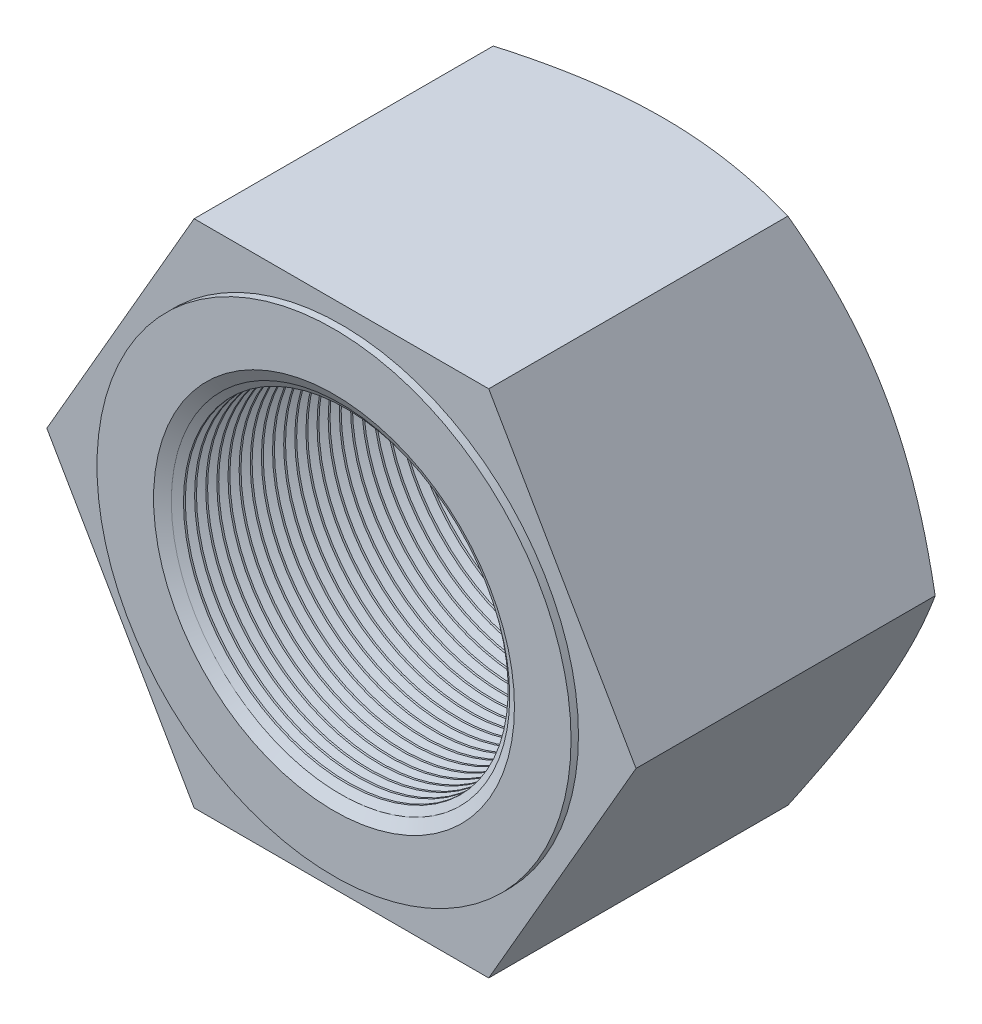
ISO-10303-21;
HEADER;
FILE_DESCRIPTION(('STEP AP214'),'2;1');
FILE_NAME('part.step','',(''),(''),'','','');
FILE_SCHEMA(('AUTOMOTIVE_DESIGN { 1 0 10303 214 1 1 1 1 }'));
ENDSEC;
DATA;
#1=APPLICATION_CONTEXT('core data for automotive mechanical design processes');
#2=APPLICATION_PROTOCOL_DEFINITION('international standard','automotive_design',2000,#1);
#3=PRODUCT_CONTEXT('',#1,'mechanical');
#4=PRODUCT('Part','Part','',(#3));
#5=PRODUCT_RELATED_PRODUCT_CATEGORY('part','',(#4));
#6=PRODUCT_DEFINITION_FORMATION('','',#4);
#7=PRODUCT_DEFINITION_CONTEXT('part definition',#1,'design');
#8=PRODUCT_DEFINITION('design','',#6,#7);
#9=PRODUCT_DEFINITION_SHAPE('','',#8);
#10=(LENGTH_UNIT() NAMED_UNIT(*) SI_UNIT(.MILLI.,.METRE.));
#11=(NAMED_UNIT(*) PLANE_ANGLE_UNIT() SI_UNIT($,.RADIAN.));
#12=(NAMED_UNIT(*) SI_UNIT($,.STERADIAN.) SOLID_ANGLE_UNIT());
#13=UNCERTAINTY_MEASURE_WITH_UNIT(LENGTH_MEASURE(1.E-05),#10,'distance_accuracy_value','');
#14=(GEOMETRIC_REPRESENTATION_CONTEXT(3) GLOBAL_UNCERTAINTY_ASSIGNED_CONTEXT((#13)) GLOBAL_UNIT_ASSIGNED_CONTEXT((#10,
#11,#12)) REPRESENTATION_CONTEXT('',''));
#15=CARTESIAN_POINT('',(0.,0.,0.));
#16=DIRECTION('',(0.,0.,1.));
#17=DIRECTION('',(1.,0.,0.));
#18=AXIS2_PLACEMENT_3D('',#15,#16,#17);
#19=CARTESIAN_POINT('',(0.,0.,-34.7));
#20=DIRECTION('',(0.,0.,1.));
#21=DIRECTION('',(1.,0.,0.));
#22=AXIS2_PLACEMENT_3D('',#19,#20,#21);
#23=CYLINDRICAL_SURFACE('',#22,17.5);
#24=CARTESIAN_POINT('',(0.,0.,-0.674166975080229));
#25=DIRECTION('',(0.,0.,-1.));
#26=DIRECTION('',(-1.,0.,0.));
#27=AXIS2_PLACEMENT_3D('',#24,#25,#26);
#28=CIRCLE('',#27,17.5);
#29=CARTESIAN_POINT('',(-17.5,0.,-0.674166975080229));
#30=VERTEX_POINT('',#29);
#31=EDGE_CURVE('E511',#30,#30,#28,.T.);
#32=ORIENTED_EDGE('',*,*,#31,.T.);
#33=EDGE_LOOP('',(#32));
#34=FACE_BOUND('',#33,.T.);
#35=CARTESIAN_POINT('',(0.,0.,-0.47416697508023));
#36=DIRECTION('',(0.,0.,-1.));
#37=DIRECTION('',(-1.,0.,0.));
#38=AXIS2_PLACEMENT_3D('',#35,#36,#37);
#39=CIRCLE('',#38,17.5);
#40=CARTESIAN_POINT('',(-17.5,0.,-0.47416697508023));
#41=VERTEX_POINT('',#40);
#42=EDGE_CURVE('E513',#41,#41,#39,.T.);
#43=ORIENTED_EDGE('',*,*,#42,.F.);
#44=EDGE_LOOP('',(#43));
#45=FACE_BOUND('',#44,.T.);
#46=ADVANCED_FACE('F34',(#34,#45),#23,.F.);
#47=CARTESIAN_POINT('',(0.,0.,-0.325833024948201));
#48=DIRECTION('',(0.,0.,1.));
#49=DIRECTION('',(1.,0.,0.));
#50=AXIS2_PLACEMENT_3D('',#47,#48,#49);
#51=CONICAL_SURFACE('',#50,17.5,1.0471975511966);
#52=CARTESIAN_POINT('',(0.,0.,0.799999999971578));
#53=DIRECTION('',(0.,0.,1.));
#54=DIRECTION('',(1.,0.,0.));
#55=AXIS2_PLACEMENT_3D('',#52,#53,#54);
#56=CIRCLE('',#55,19.45);
#57=CARTESIAN_POINT('',(19.45,0.,0.799999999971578));
#58=VERTEX_POINT('',#57);
#59=EDGE_CURVE('E11',#58,#58,#56,.F.);
#60=ORIENTED_EDGE('',*,*,#59,.F.);
#61=EDGE_LOOP('',(#60));
#62=FACE_BOUND('',#61,.T.);
#63=CARTESIAN_POINT('',(0.,0.,0.0999999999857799));
#64=DIRECTION('',(0.,0.,-1.));
#65=DIRECTION('',(-1.,0.,0.));
#66=AXIS2_PLACEMENT_3D('',#63,#64,#65);
#67=CIRCLE('',#66,18.2375644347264);
#68=CARTESIAN_POINT('',(-18.2375644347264,0.,0.0999999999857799));
#69=VERTEX_POINT('',#68);
#70=EDGE_CURVE('E38',#69,#69,#67,.T.);
#71=ORIENTED_EDGE('',*,*,#70,.T.);
#72=EDGE_LOOP('',(#71));
#73=FACE_BOUND('',#72,.T.);
#74=ADVANCED_FACE('F36',(#62,#73),#51,.F.);
#75=CARTESIAN_POINT('',(0.,0.,-1.87416697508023));
#76=DIRECTION('',(0.,0.,-1.));
#77=DIRECTION('',(-1.,0.,0.));
#78=AXIS2_PLACEMENT_3D('',#75,#76,#77);
#79=CIRCLE('',#78,17.5);
#80=CARTESIAN_POINT('',(-17.5,0.,-1.87416697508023));
#81=VERTEX_POINT('',#80);
#82=EDGE_CURVE('E502',#81,#81,#79,.T.);
#83=ORIENTED_EDGE('',*,*,#82,.T.);
#84=EDGE_LOOP('',(#83));
#85=FACE_BOUND('',#84,.T.);
#86=CARTESIAN_POINT('',(0.,0.,-1.67416697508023));
#87=DIRECTION('',(0.,0.,-1.));
#88=DIRECTION('',(-1.,0.,0.));
#89=AXIS2_PLACEMENT_3D('',#86,#87,#88);
#90=CIRCLE('',#89,17.5);
#91=CARTESIAN_POINT('',(-17.5,0.,-1.67416697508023));
#92=VERTEX_POINT('',#91);
#93=EDGE_CURVE('E505',#92,#92,#90,.T.);
#94=ORIENTED_EDGE('',*,*,#93,.F.);
#95=EDGE_LOOP('',(#94));
#96=FACE_BOUND('',#95,.T.);
#97=ADVANCED_FACE('F248',(#85,#96),#23,.F.);
#98=CARTESIAN_POINT('',(0.,0.,-3.07416697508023));
#99=DIRECTION('',(0.,0.,-1.));
#100=DIRECTION('',(-1.,0.,0.));
#101=AXIS2_PLACEMENT_3D('',#98,#99,#100);
#102=CIRCLE('',#101,17.5);
#103=CARTESIAN_POINT('',(-17.5,0.,-3.07416697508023));
#104=VERTEX_POINT('',#103);
#105=EDGE_CURVE('E493',#104,#104,#102,.T.);
#106=ORIENTED_EDGE('',*,*,#105,.T.);
#107=EDGE_LOOP('',(#106));
#108=FACE_BOUND('',#107,.T.);
#109=CARTESIAN_POINT('',(0.,0.,-2.87416697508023));
#110=DIRECTION('',(0.,0.,-1.));
#111=DIRECTION('',(-1.,0.,0.));
#112=AXIS2_PLACEMENT_3D('',#109,#110,#111);
#113=CIRCLE('',#112,17.5);
#114=CARTESIAN_POINT('',(-17.5,0.,-2.87416697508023));
#115=VERTEX_POINT('',#114);
#116=EDGE_CURVE('E496',#115,#115,#113,.T.);
#117=ORIENTED_EDGE('',*,*,#116,.F.);
#118=EDGE_LOOP('',(#117));
#119=FACE_BOUND('',#118,.T.);
#120=ADVANCED_FACE('F256',(#108,#119),#23,.F.);
#121=CARTESIAN_POINT('',(0.,0.,-4.27416697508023));
#122=DIRECTION('',(0.,0.,-1.));
#123=DIRECTION('',(-1.,0.,0.));
#124=AXIS2_PLACEMENT_3D('',#121,#122,#123);
#125=CIRCLE('',#124,17.5);
#126=CARTESIAN_POINT('',(-17.5,0.,-4.27416697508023));
#127=VERTEX_POINT('',#126);
#128=EDGE_CURVE('E484',#127,#127,#125,.T.);
#129=ORIENTED_EDGE('',*,*,#128,.T.);
#130=EDGE_LOOP('',(#129));
#131=FACE_BOUND('',#130,.T.);
#132=CARTESIAN_POINT('',(0.,0.,-4.07416697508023));
#133=DIRECTION('',(0.,0.,-1.));
#134=DIRECTION('',(-1.,0.,0.));
#135=AXIS2_PLACEMENT_3D('',#132,#133,#134);
#136=CIRCLE('',#135,17.5);
#137=CARTESIAN_POINT('',(-17.5,0.,-4.07416697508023));
#138=VERTEX_POINT('',#137);
#139=EDGE_CURVE('E487',#138,#138,#136,.T.);
#140=ORIENTED_EDGE('',*,*,#139,.F.);
#141=EDGE_LOOP('',(#140));
#142=FACE_BOUND('',#141,.T.);
#143=ADVANCED_FACE('F903',(#131,#142),#23,.F.);
#144=CARTESIAN_POINT('',(0.,0.,-5.47416697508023));
#145=DIRECTION('',(0.,0.,-1.));
#146=DIRECTION('',(-1.,0.,0.));
#147=AXIS2_PLACEMENT_3D('',#144,#145,#146);
#148=CIRCLE('',#147,17.5);
#149=CARTESIAN_POINT('',(-17.5,0.,-5.47416697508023));
#150=VERTEX_POINT('',#149);
#151=EDGE_CURVE('E475',#150,#150,#148,.T.);
#152=ORIENTED_EDGE('',*,*,#151,.T.);
#153=EDGE_LOOP('',(#152));
#154=FACE_BOUND('',#153,.T.);
#155=CARTESIAN_POINT('',(0.,0.,-5.27416697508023));
#156=DIRECTION('',(0.,0.,-1.));
#157=DIRECTION('',(-1.,0.,0.));
#158=AXIS2_PLACEMENT_3D('',#155,#156,#157);
#159=CIRCLE('',#158,17.5);
#160=CARTESIAN_POINT('',(-17.5,0.,-5.27416697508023));
#161=VERTEX_POINT('',#160);
#162=EDGE_CURVE('E478',#161,#161,#159,.T.);
#163=ORIENTED_EDGE('',*,*,#162,.F.);
#164=EDGE_LOOP('',(#163));
#165=FACE_BOUND('',#164,.T.);
#166=ADVANCED_FACE('F913',(#154,#165),#23,.F.);
#167=CARTESIAN_POINT('',(0.,0.,-6.67416697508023));
#168=DIRECTION('',(0.,0.,-1.));
#169=DIRECTION('',(-1.,0.,0.));
#170=AXIS2_PLACEMENT_3D('',#167,#168,#169);
#171=CIRCLE('',#170,17.5);
#172=CARTESIAN_POINT('',(-17.5,0.,-6.67416697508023));
#173=VERTEX_POINT('',#172);
#174=EDGE_CURVE('E466',#173,#173,#171,.T.);
#175=ORIENTED_EDGE('',*,*,#174,.T.);
#176=EDGE_LOOP('',(#175));
#177=FACE_BOUND('',#176,.T.);
#178=CARTESIAN_POINT('',(0.,0.,-6.47416697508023));
#179=DIRECTION('',(0.,0.,-1.));
#180=DIRECTION('',(-1.,0.,0.));
#181=AXIS2_PLACEMENT_3D('',#178,#179,#180);
#182=CIRCLE('',#181,17.5);
#183=CARTESIAN_POINT('',(-17.5,0.,-6.47416697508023));
#184=VERTEX_POINT('',#183);
#185=EDGE_CURVE('E469',#184,#184,#182,.T.);
#186=ORIENTED_EDGE('',*,*,#185,.F.);
#187=EDGE_LOOP('',(#186));
#188=FACE_BOUND('',#187,.T.);
#189=ADVANCED_FACE('F923',(#177,#188),#23,.F.);
#190=CARTESIAN_POINT('',(0.,0.,-7.87416697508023));
#191=DIRECTION('',(0.,0.,-1.));
#192=DIRECTION('',(-1.,0.,0.));
#193=AXIS2_PLACEMENT_3D('',#190,#191,#192);
#194=CIRCLE('',#193,17.5);
#195=CARTESIAN_POINT('',(-17.5,0.,-7.87416697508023));
#196=VERTEX_POINT('',#195);
#197=EDGE_CURVE('E457',#196,#196,#194,.T.);
#198=ORIENTED_EDGE('',*,*,#197,.T.);
#199=EDGE_LOOP('',(#198));
#200=FACE_BOUND('',#199,.T.);
#201=CARTESIAN_POINT('',(0.,0.,-7.67416697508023));
#202=DIRECTION('',(0.,0.,-1.));
#203=DIRECTION('',(-1.,0.,0.));
#204=AXIS2_PLACEMENT_3D('',#201,#202,#203);
#205=CIRCLE('',#204,17.5);
#206=CARTESIAN_POINT('',(-17.5,0.,-7.67416697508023));
#207=VERTEX_POINT('',#206);
#208=EDGE_CURVE('E460',#207,#207,#205,.T.);
#209=ORIENTED_EDGE('',*,*,#208,.F.);
#210=EDGE_LOOP('',(#209));
#211=FACE_BOUND('',#210,.T.);
#212=ADVANCED_FACE('F933',(#200,#211),#23,.F.);
#213=CARTESIAN_POINT('',(0.,0.,-9.07416697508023));
#214=DIRECTION('',(0.,0.,-1.));
#215=DIRECTION('',(-1.,0.,0.));
#216=AXIS2_PLACEMENT_3D('',#213,#214,#215);
#217=CIRCLE('',#216,17.5);
#218=CARTESIAN_POINT('',(-17.5,0.,-9.07416697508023));
#219=VERTEX_POINT('',#218);
#220=EDGE_CURVE('E448',#219,#219,#217,.T.);
#221=ORIENTED_EDGE('',*,*,#220,.T.);
#222=EDGE_LOOP('',(#221));
#223=FACE_BOUND('',#222,.T.);
#224=CARTESIAN_POINT('',(0.,0.,-8.87416697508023));
#225=DIRECTION('',(0.,0.,-1.));
#226=DIRECTION('',(-1.,0.,0.));
#227=AXIS2_PLACEMENT_3D('',#224,#225,#226);
#228=CIRCLE('',#227,17.5);
#229=CARTESIAN_POINT('',(-17.5,0.,-8.87416697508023));
#230=VERTEX_POINT('',#229);
#231=EDGE_CURVE('E451',#230,#230,#228,.T.);
#232=ORIENTED_EDGE('',*,*,#231,.F.);
#233=EDGE_LOOP('',(#232));
#234=FACE_BOUND('',#233,.T.);
#235=ADVANCED_FACE('F943',(#223,#234),#23,.F.);
#236=CARTESIAN_POINT('',(0.,0.,-10.2741669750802));
#237=DIRECTION('',(0.,0.,-1.));
#238=DIRECTION('',(-1.,0.,0.));
#239=AXIS2_PLACEMENT_3D('',#236,#237,#238);
#240=CIRCLE('',#239,17.5);
#241=CARTESIAN_POINT('',(-17.5,0.,-10.2741669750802));
#242=VERTEX_POINT('',#241);
#243=EDGE_CURVE('E439',#242,#242,#240,.T.);
#244=ORIENTED_EDGE('',*,*,#243,.T.);
#245=EDGE_LOOP('',(#244));
#246=FACE_BOUND('',#245,.T.);
#247=CARTESIAN_POINT('',(0.,0.,-10.0741669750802));
#248=DIRECTION('',(0.,0.,-1.));
#249=DIRECTION('',(-1.,0.,0.));
#250=AXIS2_PLACEMENT_3D('',#247,#248,#249);
#251=CIRCLE('',#250,17.5);
#252=CARTESIAN_POINT('',(-17.5,0.,-10.0741669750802));
#253=VERTEX_POINT('',#252);
#254=EDGE_CURVE('E442',#253,#253,#251,.T.);
#255=ORIENTED_EDGE('',*,*,#254,.F.);
#256=EDGE_LOOP('',(#255));
#257=FACE_BOUND('',#256,.T.);
#258=ADVANCED_FACE('F953',(#246,#257),#23,.F.);
#259=CARTESIAN_POINT('',(0.,0.,-11.4741669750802));
#260=DIRECTION('',(0.,0.,-1.));
#261=DIRECTION('',(-1.,0.,0.));
#262=AXIS2_PLACEMENT_3D('',#259,#260,#261);
#263=CIRCLE('',#262,17.5);
#264=CARTESIAN_POINT('',(-17.5,0.,-11.4741669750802));
#265=VERTEX_POINT('',#264);
#266=EDGE_CURVE('E430',#265,#265,#263,.T.);
#267=ORIENTED_EDGE('',*,*,#266,.T.);
#268=EDGE_LOOP('',(#267));
#269=FACE_BOUND('',#268,.T.);
#270=CARTESIAN_POINT('',(0.,0.,-11.2741669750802));
#271=DIRECTION('',(0.,0.,-1.));
#272=DIRECTION('',(-1.,0.,0.));
#273=AXIS2_PLACEMENT_3D('',#270,#271,#272);
#274=CIRCLE('',#273,17.5);
#275=CARTESIAN_POINT('',(-17.5,0.,-11.2741669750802));
#276=VERTEX_POINT('',#275);
#277=EDGE_CURVE('E433',#276,#276,#274,.T.);
#278=ORIENTED_EDGE('',*,*,#277,.F.);
#279=EDGE_LOOP('',(#278));
#280=FACE_BOUND('',#279,.T.);
#281=ADVANCED_FACE('F963',(#269,#280),#23,.F.);
#282=CARTESIAN_POINT('',(0.,0.,-12.6741669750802));
#283=DIRECTION('',(0.,0.,-1.));
#284=DIRECTION('',(-1.,0.,0.));
#285=AXIS2_PLACEMENT_3D('',#282,#283,#284);
#286=CIRCLE('',#285,17.5);
#287=CARTESIAN_POINT('',(-17.5,0.,-12.6741669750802));
#288=VERTEX_POINT('',#287);
#289=EDGE_CURVE('E421',#288,#288,#286,.T.);
#290=ORIENTED_EDGE('',*,*,#289,.T.);
#291=EDGE_LOOP('',(#290));
#292=FACE_BOUND('',#291,.T.);
#293=CARTESIAN_POINT('',(0.,0.,-12.4741669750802));
#294=DIRECTION('',(0.,0.,-1.));
#295=DIRECTION('',(-1.,0.,0.));
#296=AXIS2_PLACEMENT_3D('',#293,#294,#295);
#297=CIRCLE('',#296,17.5);
#298=CARTESIAN_POINT('',(-17.5,0.,-12.4741669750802));
#299=VERTEX_POINT('',#298);
#300=EDGE_CURVE('E424',#299,#299,#297,.T.);
#301=ORIENTED_EDGE('',*,*,#300,.F.);
#302=EDGE_LOOP('',(#301));
#303=FACE_BOUND('',#302,.T.);
#304=ADVANCED_FACE('F973',(#292,#303),#23,.F.);
#305=CARTESIAN_POINT('',(0.,0.,-13.8741669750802));
#306=DIRECTION('',(0.,0.,-1.));
#307=DIRECTION('',(-1.,0.,0.));
#308=AXIS2_PLACEMENT_3D('',#305,#306,#307);
#309=CIRCLE('',#308,17.5);
#310=CARTESIAN_POINT('',(-17.5,0.,-13.8741669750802));
#311=VERTEX_POINT('',#310);
#312=EDGE_CURVE('E412',#311,#311,#309,.T.);
#313=ORIENTED_EDGE('',*,*,#312,.T.);
#314=EDGE_LOOP('',(#313));
#315=FACE_BOUND('',#314,.T.);
#316=CARTESIAN_POINT('',(0.,0.,-13.6741669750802));
#317=DIRECTION('',(0.,0.,-1.));
#318=DIRECTION('',(-1.,0.,0.));
#319=AXIS2_PLACEMENT_3D('',#316,#317,#318);
#320=CIRCLE('',#319,17.5);
#321=CARTESIAN_POINT('',(-17.5,0.,-13.6741669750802));
#322=VERTEX_POINT('',#321);
#323=EDGE_CURVE('E415',#322,#322,#320,.T.);
#324=ORIENTED_EDGE('',*,*,#323,.F.);
#325=EDGE_LOOP('',(#324));
#326=FACE_BOUND('',#325,.T.);
#327=ADVANCED_FACE('F983',(#315,#326),#23,.F.);
#328=CARTESIAN_POINT('',(0.,0.,-15.0741669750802));
#329=DIRECTION('',(0.,0.,-1.));
#330=DIRECTION('',(-1.,0.,0.));
#331=AXIS2_PLACEMENT_3D('',#328,#329,#330);
#332=CIRCLE('',#331,17.5);
#333=CARTESIAN_POINT('',(-17.5,0.,-15.0741669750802));
#334=VERTEX_POINT('',#333);
#335=EDGE_CURVE('E403',#334,#334,#332,.T.);
#336=ORIENTED_EDGE('',*,*,#335,.T.);
#337=EDGE_LOOP('',(#336));
#338=FACE_BOUND('',#337,.T.);
#339=CARTESIAN_POINT('',(0.,0.,-14.8741669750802));
#340=DIRECTION('',(0.,0.,-1.));
#341=DIRECTION('',(-1.,0.,0.));
#342=AXIS2_PLACEMENT_3D('',#339,#340,#341);
#343=CIRCLE('',#342,17.5);
#344=CARTESIAN_POINT('',(-17.5,0.,-14.8741669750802));
#345=VERTEX_POINT('',#344);
#346=EDGE_CURVE('E406',#345,#345,#343,.T.);
#347=ORIENTED_EDGE('',*,*,#346,.F.);
#348=EDGE_LOOP('',(#347));
#349=FACE_BOUND('',#348,.T.);
#350=ADVANCED_FACE('F993',(#338,#349),#23,.F.);
#351=CARTESIAN_POINT('',(0.,0.,-16.2741669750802));
#352=DIRECTION('',(0.,0.,-1.));
#353=DIRECTION('',(-1.,0.,0.));
#354=AXIS2_PLACEMENT_3D('',#351,#352,#353);
#355=CIRCLE('',#354,17.5);
#356=CARTESIAN_POINT('',(-17.5,0.,-16.2741669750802));
#357=VERTEX_POINT('',#356);
#358=EDGE_CURVE('E394',#357,#357,#355,.T.);
#359=ORIENTED_EDGE('',*,*,#358,.T.);
#360=EDGE_LOOP('',(#359));
#361=FACE_BOUND('',#360,.T.);
#362=CARTESIAN_POINT('',(0.,0.,-16.0741669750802));
#363=DIRECTION('',(0.,0.,-1.));
#364=DIRECTION('',(-1.,0.,0.));
#365=AXIS2_PLACEMENT_3D('',#362,#363,#364);
#366=CIRCLE('',#365,17.5);
#367=CARTESIAN_POINT('',(-17.5,0.,-16.0741669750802));
#368=VERTEX_POINT('',#367);
#369=EDGE_CURVE('E397',#368,#368,#366,.T.);
#370=ORIENTED_EDGE('',*,*,#369,.F.);
#371=EDGE_LOOP('',(#370));
#372=FACE_BOUND('',#371,.T.);
#373=ADVANCED_FACE('F1003',(#361,#372),#23,.F.);
#374=CARTESIAN_POINT('',(0.,0.,-17.4741669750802));
#375=DIRECTION('',(0.,0.,-1.));
#376=DIRECTION('',(-1.,0.,0.));
#377=AXIS2_PLACEMENT_3D('',#374,#375,#376);
#378=CIRCLE('',#377,17.5);
#379=CARTESIAN_POINT('',(-17.5,0.,-17.4741669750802));
#380=VERTEX_POINT('',#379);
#381=EDGE_CURVE('E385',#380,#380,#378,.T.);
#382=ORIENTED_EDGE('',*,*,#381,.T.);
#383=EDGE_LOOP('',(#382));
#384=FACE_BOUND('',#383,.T.);
#385=CARTESIAN_POINT('',(0.,0.,-17.2741669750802));
#386=DIRECTION('',(0.,0.,-1.));
#387=DIRECTION('',(-1.,0.,0.));
#388=AXIS2_PLACEMENT_3D('',#385,#386,#387);
#389=CIRCLE('',#388,17.5);
#390=CARTESIAN_POINT('',(-17.5,0.,-17.2741669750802));
#391=VERTEX_POINT('',#390);
#392=EDGE_CURVE('E388',#391,#391,#389,.T.);
#393=ORIENTED_EDGE('',*,*,#392,.F.);
#394=EDGE_LOOP('',(#393));
#395=FACE_BOUND('',#394,.T.);
#396=ADVANCED_FACE('F1013',(#384,#395),#23,.F.);
#397=CARTESIAN_POINT('',(0.,0.,-18.6741669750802));
#398=DIRECTION('',(0.,0.,-1.));
#399=DIRECTION('',(-1.,0.,0.));
#400=AXIS2_PLACEMENT_3D('',#397,#398,#399);
#401=CIRCLE('',#400,17.5);
#402=CARTESIAN_POINT('',(-17.5,0.,-18.6741669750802));
#403=VERTEX_POINT('',#402);
#404=EDGE_CURVE('E376',#403,#403,#401,.T.);
#405=ORIENTED_EDGE('',*,*,#404,.T.);
#406=EDGE_LOOP('',(#405));
#407=FACE_BOUND('',#406,.T.);
#408=CARTESIAN_POINT('',(0.,0.,-18.4741669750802));
#409=DIRECTION('',(0.,0.,-1.));
#410=DIRECTION('',(-1.,0.,0.));
#411=AXIS2_PLACEMENT_3D('',#408,#409,#410);
#412=CIRCLE('',#411,17.5);
#413=CARTESIAN_POINT('',(-17.5,0.,-18.4741669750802));
#414=VERTEX_POINT('',#413);
#415=EDGE_CURVE('E379',#414,#414,#412,.T.);
#416=ORIENTED_EDGE('',*,*,#415,.F.);
#417=EDGE_LOOP('',(#416));
#418=FACE_BOUND('',#417,.T.);
#419=ADVANCED_FACE('F1023',(#407,#418),#23,.F.);
#420=CARTESIAN_POINT('',(0.,0.,-19.8741669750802));
#421=DIRECTION('',(0.,0.,-1.));
#422=DIRECTION('',(-1.,0.,0.));
#423=AXIS2_PLACEMENT_3D('',#420,#421,#422);
#424=CIRCLE('',#423,17.5);
#425=CARTESIAN_POINT('',(-17.5,0.,-19.8741669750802));
#426=VERTEX_POINT('',#425);
#427=EDGE_CURVE('E367',#426,#426,#424,.T.);
#428=ORIENTED_EDGE('',*,*,#427,.T.);
#429=EDGE_LOOP('',(#428));
#430=FACE_BOUND('',#429,.T.);
#431=CARTESIAN_POINT('',(0.,0.,-19.6741669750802));
#432=DIRECTION('',(0.,0.,-1.));
#433=DIRECTION('',(-1.,0.,0.));
#434=AXIS2_PLACEMENT_3D('',#431,#432,#433);
#435=CIRCLE('',#434,17.5);
#436=CARTESIAN_POINT('',(-17.5,0.,-19.6741669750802));
#437=VERTEX_POINT('',#436);
#438=EDGE_CURVE('E370',#437,#437,#435,.T.);
#439=ORIENTED_EDGE('',*,*,#438,.F.);
#440=EDGE_LOOP('',(#439));
#441=FACE_BOUND('',#440,.T.);
#442=ADVANCED_FACE('F1033',(#430,#441),#23,.F.);
#443=CARTESIAN_POINT('',(0.,0.,-21.0741669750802));
#444=DIRECTION('',(0.,0.,-1.));
#445=DIRECTION('',(-1.,0.,0.));
#446=AXIS2_PLACEMENT_3D('',#443,#444,#445);
#447=CIRCLE('',#446,17.5);
#448=CARTESIAN_POINT('',(-17.5,0.,-21.0741669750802));
#449=VERTEX_POINT('',#448);
#450=EDGE_CURVE('E358',#449,#449,#447,.T.);
#451=ORIENTED_EDGE('',*,*,#450,.T.);
#452=EDGE_LOOP('',(#451));
#453=FACE_BOUND('',#452,.T.);
#454=CARTESIAN_POINT('',(0.,0.,-20.8741669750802));
#455=DIRECTION('',(0.,0.,-1.));
#456=DIRECTION('',(-1.,0.,0.));
#457=AXIS2_PLACEMENT_3D('',#454,#455,#456);
#458=CIRCLE('',#457,17.5);
#459=CARTESIAN_POINT('',(-17.5,0.,-20.8741669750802));
#460=VERTEX_POINT('',#459);
#461=EDGE_CURVE('E361',#460,#460,#458,.T.);
#462=ORIENTED_EDGE('',*,*,#461,.F.);
#463=EDGE_LOOP('',(#462));
#464=FACE_BOUND('',#463,.T.);
#465=ADVANCED_FACE('F1043',(#453,#464),#23,.F.);
#466=CARTESIAN_POINT('',(0.,0.,-22.2741669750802));
#467=DIRECTION('',(0.,0.,-1.));
#468=DIRECTION('',(-1.,0.,0.));
#469=AXIS2_PLACEMENT_3D('',#466,#467,#468);
#470=CIRCLE('',#469,17.5);
#471=CARTESIAN_POINT('',(-17.5,0.,-22.2741669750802));
#472=VERTEX_POINT('',#471);
#473=EDGE_CURVE('E349',#472,#472,#470,.T.);
#474=ORIENTED_EDGE('',*,*,#473,.T.);
#475=EDGE_LOOP('',(#474));
#476=FACE_BOUND('',#475,.T.);
#477=CARTESIAN_POINT('',(0.,0.,-22.0741669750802));
#478=DIRECTION('',(0.,0.,-1.));
#479=DIRECTION('',(-1.,0.,0.));
#480=AXIS2_PLACEMENT_3D('',#477,#478,#479);
#481=CIRCLE('',#480,17.5);
#482=CARTESIAN_POINT('',(-17.5,0.,-22.0741669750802));
#483=VERTEX_POINT('',#482);
#484=EDGE_CURVE('E352',#483,#483,#481,.T.);
#485=ORIENTED_EDGE('',*,*,#484,.F.);
#486=EDGE_LOOP('',(#485));
#487=FACE_BOUND('',#486,.T.);
#488=ADVANCED_FACE('F1053',(#476,#487),#23,.F.);
#489=CARTESIAN_POINT('',(0.,0.,-23.4741669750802));
#490=DIRECTION('',(0.,0.,-1.));
#491=DIRECTION('',(-1.,0.,0.));
#492=AXIS2_PLACEMENT_3D('',#489,#490,#491);
#493=CIRCLE('',#492,17.5);
#494=CARTESIAN_POINT('',(-17.5,0.,-23.4741669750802));
#495=VERTEX_POINT('',#494);
#496=EDGE_CURVE('E340',#495,#495,#493,.T.);
#497=ORIENTED_EDGE('',*,*,#496,.T.);
#498=EDGE_LOOP('',(#497));
#499=FACE_BOUND('',#498,.T.);
#500=CARTESIAN_POINT('',(0.,0.,-23.2741669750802));
#501=DIRECTION('',(0.,0.,-1.));
#502=DIRECTION('',(-1.,0.,0.));
#503=AXIS2_PLACEMENT_3D('',#500,#501,#502);
#504=CIRCLE('',#503,17.5);
#505=CARTESIAN_POINT('',(-17.5,0.,-23.2741669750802));
#506=VERTEX_POINT('',#505);
#507=EDGE_CURVE('E343',#506,#506,#504,.T.);
#508=ORIENTED_EDGE('',*,*,#507,.F.);
#509=EDGE_LOOP('',(#508));
#510=FACE_BOUND('',#509,.T.);
#511=ADVANCED_FACE('F1063',(#499,#510),#23,.F.);
#512=CARTESIAN_POINT('',(0.,0.,-24.6741669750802));
#513=DIRECTION('',(0.,0.,-1.));
#514=DIRECTION('',(-1.,0.,0.));
#515=AXIS2_PLACEMENT_3D('',#512,#513,#514);
#516=CIRCLE('',#515,17.5);
#517=CARTESIAN_POINT('',(-17.5,0.,-24.6741669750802));
#518=VERTEX_POINT('',#517);
#519=EDGE_CURVE('E331',#518,#518,#516,.T.);
#520=ORIENTED_EDGE('',*,*,#519,.T.);
#521=EDGE_LOOP('',(#520));
#522=FACE_BOUND('',#521,.T.);
#523=CARTESIAN_POINT('',(0.,0.,-24.4741669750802));
#524=DIRECTION('',(0.,0.,-1.));
#525=DIRECTION('',(-1.,0.,0.));
#526=AXIS2_PLACEMENT_3D('',#523,#524,#525);
#527=CIRCLE('',#526,17.5);
#528=CARTESIAN_POINT('',(-17.5,0.,-24.4741669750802));
#529=VERTEX_POINT('',#528);
#530=EDGE_CURVE('E334',#529,#529,#527,.T.);
#531=ORIENTED_EDGE('',*,*,#530,.F.);
#532=EDGE_LOOP('',(#531));
#533=FACE_BOUND('',#532,.T.);
#534=ADVANCED_FACE('F1073',(#522,#533),#23,.F.);
#535=CARTESIAN_POINT('',(0.,0.,-25.8741669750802));
#536=DIRECTION('',(0.,0.,-1.));
#537=DIRECTION('',(-1.,0.,0.));
#538=AXIS2_PLACEMENT_3D('',#535,#536,#537);
#539=CIRCLE('',#538,17.5);
#540=CARTESIAN_POINT('',(-17.5,0.,-25.8741669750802));
#541=VERTEX_POINT('',#540);
#542=EDGE_CURVE('E322',#541,#541,#539,.T.);
#543=ORIENTED_EDGE('',*,*,#542,.T.);
#544=EDGE_LOOP('',(#543));
#545=FACE_BOUND('',#544,.T.);
#546=CARTESIAN_POINT('',(0.,0.,-25.6741669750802));
#547=DIRECTION('',(0.,0.,-1.));
#548=DIRECTION('',(-1.,0.,0.));
#549=AXIS2_PLACEMENT_3D('',#546,#547,#548);
#550=CIRCLE('',#549,17.5);
#551=CARTESIAN_POINT('',(-17.5,0.,-25.6741669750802));
#552=VERTEX_POINT('',#551);
#553=EDGE_CURVE('E325',#552,#552,#550,.T.);
#554=ORIENTED_EDGE('',*,*,#553,.F.);
#555=EDGE_LOOP('',(#554));
#556=FACE_BOUND('',#555,.T.);
#557=ADVANCED_FACE('F1083',(#545,#556),#23,.F.);
#558=CARTESIAN_POINT('',(0.,0.,-27.0741669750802));
#559=DIRECTION('',(0.,0.,-1.));
#560=DIRECTION('',(-1.,0.,0.));
#561=AXIS2_PLACEMENT_3D('',#558,#559,#560);
#562=CIRCLE('',#561,17.5);
#563=CARTESIAN_POINT('',(-17.5,0.,-27.0741669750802));
#564=VERTEX_POINT('',#563);
#565=EDGE_CURVE('E313',#564,#564,#562,.T.);
#566=ORIENTED_EDGE('',*,*,#565,.T.);
#567=EDGE_LOOP('',(#566));
#568=FACE_BOUND('',#567,.T.);
#569=CARTESIAN_POINT('',(0.,0.,-26.8741669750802));
#570=DIRECTION('',(0.,0.,-1.));
#571=DIRECTION('',(-1.,0.,0.));
#572=AXIS2_PLACEMENT_3D('',#569,#570,#571);
#573=CIRCLE('',#572,17.5);
#574=CARTESIAN_POINT('',(-17.5,0.,-26.8741669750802));
#575=VERTEX_POINT('',#574);
#576=EDGE_CURVE('E316',#575,#575,#573,.T.);
#577=ORIENTED_EDGE('',*,*,#576,.F.);
#578=EDGE_LOOP('',(#577));
#579=FACE_BOUND('',#578,.T.);
#580=ADVANCED_FACE('F1093',(#568,#579),#23,.F.);
#581=CARTESIAN_POINT('',(0.,0.,-28.2741669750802));
#582=DIRECTION('',(0.,0.,-1.));
#583=DIRECTION('',(-1.,0.,0.));
#584=AXIS2_PLACEMENT_3D('',#581,#582,#583);
#585=CIRCLE('',#584,17.5);
#586=CARTESIAN_POINT('',(-17.5,0.,-28.2741669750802));
#587=VERTEX_POINT('',#586);
#588=EDGE_CURVE('E304',#587,#587,#585,.T.);
#589=ORIENTED_EDGE('',*,*,#588,.T.);
#590=EDGE_LOOP('',(#589));
#591=FACE_BOUND('',#590,.T.);
#592=CARTESIAN_POINT('',(0.,0.,-28.0741669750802));
#593=DIRECTION('',(0.,0.,-1.));
#594=DIRECTION('',(-1.,0.,0.));
#595=AXIS2_PLACEMENT_3D('',#592,#593,#594);
#596=CIRCLE('',#595,17.5);
#597=CARTESIAN_POINT('',(-17.5,0.,-28.0741669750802));
#598=VERTEX_POINT('',#597);
#599=EDGE_CURVE('E307',#598,#598,#596,.T.);
#600=ORIENTED_EDGE('',*,*,#599,.F.);
#601=EDGE_LOOP('',(#600));
#602=FACE_BOUND('',#601,.T.);
#603=ADVANCED_FACE('F1103',(#591,#602),#23,.F.);
#604=CARTESIAN_POINT('',(0.,0.,-29.4741669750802));
#605=DIRECTION('',(0.,0.,-1.));
#606=DIRECTION('',(-1.,0.,0.));
#607=AXIS2_PLACEMENT_3D('',#604,#605,#606);
#608=CIRCLE('',#607,17.5);
#609=CARTESIAN_POINT('',(-17.5,0.,-29.4741669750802));
#610=VERTEX_POINT('',#609);
#611=EDGE_CURVE('E295',#610,#610,#608,.T.);
#612=ORIENTED_EDGE('',*,*,#611,.T.);
#613=EDGE_LOOP('',(#612));
#614=FACE_BOUND('',#613,.T.);
#615=CARTESIAN_POINT('',(0.,0.,-29.2741669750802));
#616=DIRECTION('',(0.,0.,-1.));
#617=DIRECTION('',(-1.,0.,0.));
#618=AXIS2_PLACEMENT_3D('',#615,#616,#617);
#619=CIRCLE('',#618,17.5);
#620=CARTESIAN_POINT('',(-17.5,0.,-29.2741669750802));
#621=VERTEX_POINT('',#620);
#622=EDGE_CURVE('E298',#621,#621,#619,.T.);
#623=ORIENTED_EDGE('',*,*,#622,.F.);
#624=EDGE_LOOP('',(#623));
#625=FACE_BOUND('',#624,.T.);
#626=ADVANCED_FACE('F1113',(#614,#625),#23,.F.);
#627=CARTESIAN_POINT('',(0.,0.,-30.6741669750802));
#628=DIRECTION('',(0.,0.,-1.));
#629=DIRECTION('',(-1.,0.,0.));
#630=AXIS2_PLACEMENT_3D('',#627,#628,#629);
#631=CIRCLE('',#630,17.5);
#632=CARTESIAN_POINT('',(-17.5,0.,-30.6741669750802));
#633=VERTEX_POINT('',#632);
#634=EDGE_CURVE('E286',#633,#633,#631,.T.);
#635=ORIENTED_EDGE('',*,*,#634,.T.);
#636=EDGE_LOOP('',(#635));
#637=FACE_BOUND('',#636,.T.);
#638=CARTESIAN_POINT('',(0.,0.,-30.4741669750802));
#639=DIRECTION('',(0.,0.,-1.));
#640=DIRECTION('',(-1.,0.,0.));
#641=AXIS2_PLACEMENT_3D('',#638,#639,#640);
#642=CIRCLE('',#641,17.5);
#643=CARTESIAN_POINT('',(-17.5,0.,-30.4741669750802));
#644=VERTEX_POINT('',#643);
#645=EDGE_CURVE('E289',#644,#644,#642,.T.);
#646=ORIENTED_EDGE('',*,*,#645,.F.);
#647=EDGE_LOOP('',(#646));
#648=FACE_BOUND('',#647,.T.);
#649=ADVANCED_FACE('F266',(#637,#648),#23,.F.);
#650=CARTESIAN_POINT('',(0.,0.,-31.8741669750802));
#651=DIRECTION('',(0.,0.,-1.));
#652=DIRECTION('',(-1.,0.,0.));
#653=AXIS2_PLACEMENT_3D('',#650,#651,#652);
#654=CIRCLE('',#653,17.5);
#655=CARTESIAN_POINT('',(-17.5,0.,-31.8741669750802));
#656=VERTEX_POINT('',#655);
#657=EDGE_CURVE('E275',#656,#656,#654,.T.);
#658=ORIENTED_EDGE('',*,*,#657,.T.);
#659=EDGE_LOOP('',(#658));
#660=FACE_BOUND('',#659,.T.);
#661=CARTESIAN_POINT('',(0.,0.,-31.6741669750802));
#662=DIRECTION('',(0.,0.,-1.));
#663=DIRECTION('',(-1.,0.,0.));
#664=AXIS2_PLACEMENT_3D('',#661,#662,#663);
#665=CIRCLE('',#664,17.5);
#666=CARTESIAN_POINT('',(-17.5,0.,-31.6741669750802));
#667=VERTEX_POINT('',#666);
#668=EDGE_CURVE('E280',#667,#667,#665,.T.);
#669=ORIENTED_EDGE('',*,*,#668,.F.);
#670=EDGE_LOOP('',(#669));
#671=FACE_BOUND('',#670,.T.);
#672=ADVANCED_FACE('F259',(#660,#671),#23,.F.);
#673=CARTESIAN_POINT('',(0.,0.,-33.0741669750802));
#674=DIRECTION('',(0.,0.,-1.));
#675=DIRECTION('',(-1.,0.,0.));
#676=AXIS2_PLACEMENT_3D('',#673,#674,#675);
#677=CIRCLE('',#676,17.5);
#678=CARTESIAN_POINT('',(-17.5,0.,-33.0741669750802));
#679=VERTEX_POINT('',#678);
#680=EDGE_CURVE('E155',#679,#679,#677,.T.);
#681=ORIENTED_EDGE('',*,*,#680,.T.);
#682=EDGE_LOOP('',(#681));
#683=FACE_BOUND('',#682,.T.);
#684=CARTESIAN_POINT('',(0.,0.,-32.8741669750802));
#685=DIRECTION('',(0.,0.,-1.));
#686=DIRECTION('',(-1.,0.,0.));
#687=AXIS2_PLACEMENT_3D('',#684,#685,#686);
#688=CIRCLE('',#687,17.5);
#689=CARTESIAN_POINT('',(-17.5,0.,-32.8741669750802));
#690=VERTEX_POINT('',#689);
#691=EDGE_CURVE('E160',#690,#690,#688,.T.);
#692=ORIENTED_EDGE('',*,*,#691,.F.);
#693=EDGE_LOOP('',(#692));
#694=FACE_BOUND('',#693,.T.);
#695=ADVANCED_FACE('F200',(#683,#694),#23,.F.);
#696=CARTESIAN_POINT('',(0.,0.,-33.5741669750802));
#697=DIRECTION('',(0.,0.,-1.));
#698=DIRECTION('',(-1.,0.,0.));
#699=AXIS2_PLACEMENT_3D('',#696,#697,#698);
#700=CONICAL_SURFACE('',#699,17.5,1.04719755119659);
#701=CARTESIAN_POINT('',(0.,0.,-34.7));
#702=DIRECTION('',(0.,0.,1.));
#703=DIRECTION('',(1.,0.,0.));
#704=AXIS2_PLACEMENT_3D('',#701,#702,#703);
#705=CIRCLE('',#704,19.45);
#706=CARTESIAN_POINT('',(19.45,0.,-34.7));
#707=VERTEX_POINT('',#706);
#708=EDGE_CURVE('E165',#707,#707,#705,.T.);
#709=ORIENTED_EDGE('',*,*,#708,.F.);
#710=EDGE_LOOP('',(#709));
#711=FACE_BOUND('',#710,.T.);
#712=CARTESIAN_POINT('',(0.,0.,-33.8241669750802));
#713=DIRECTION('',(0.,0.,1.));
#714=DIRECTION('',(1.,0.,0.));
#715=AXIS2_PLACEMENT_3D('',#712,#713,#714);
#716=CIRCLE('',#715,17.9330127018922);
#717=CARTESIAN_POINT('',(17.9330127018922,0.,-33.8241669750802));
#718=VERTEX_POINT('',#717);
#719=EDGE_CURVE('E145',#718,#718,#716,.F.);
#720=ORIENTED_EDGE('',*,*,#719,.F.);
#721=EDGE_LOOP('',(#720));
#722=FACE_BOUND('',#721,.T.);
#723=ADVANCED_FACE('F198',(#711,#722),#700,.F.);
#724=CARTESIAN_POINT('',(15.8771324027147,-27.5,0.));
#725=DIRECTION('',(0.,0.,1.));
#726=DIRECTION('',(1.,0.,0.));
#727=AXIS2_PLACEMENT_3D('',#724,#725,#726);
#728=PLANE('',#727);
#729=DIRECTION('',(1.,0.,0.));
#730=VECTOR('',#729,1.);
#731=CARTESIAN_POINT('',(-15.8771324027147,-27.5,0.));
#732=LINE('',#731,#730);
#733=CARTESIAN_POINT('',(-15.8771324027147,-27.5,0.));
#734=VERTEX_POINT('',#733);
#735=CARTESIAN_POINT('',(15.8771324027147,-27.5,0.));
#736=VERTEX_POINT('',#735);
#737=EDGE_CURVE('E776',#734,#736,#732,.T.);
#738=ORIENTED_EDGE('',*,*,#737,.T.);
#739=DIRECTION('',(0.5,0.866025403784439,0.));
#740=VECTOR('',#739,1.);
#741=CARTESIAN_POINT('',(15.8771324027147,-27.5,0.));
#742=LINE('',#741,#740);
#743=CARTESIAN_POINT('',(31.7542648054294,0.,0.));
#744=VERTEX_POINT('',#743);
#745=EDGE_CURVE('E779',#736,#744,#742,.T.);
#746=ORIENTED_EDGE('',*,*,#745,.T.);
#747=DIRECTION('',(-0.5,0.866025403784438,0.));
#748=VECTOR('',#747,1.);
#749=CARTESIAN_POINT('',(31.7542648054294,0.,0.));
#750=LINE('',#749,#748);
#751=CARTESIAN_POINT('',(15.8771324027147,27.5,0.));
#752=VERTEX_POINT('',#751);
#753=EDGE_CURVE('E781',#744,#752,#750,.T.);
#754=ORIENTED_EDGE('',*,*,#753,.T.);
#755=DIRECTION('',(-1.,0.,0.));
#756=VECTOR('',#755,1.);
#757=CARTESIAN_POINT('',(15.8771324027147,27.5,0.));
#758=LINE('',#757,#756);
#759=CARTESIAN_POINT('',(-15.8771324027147,27.5,0.));
#760=VERTEX_POINT('',#759);
#761=EDGE_CURVE('E785',#752,#760,#758,.T.);
#762=ORIENTED_EDGE('',*,*,#761,.T.);
#763=DIRECTION('',(-0.5,-0.866025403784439,0.));
#764=VECTOR('',#763,1.);
#765=CARTESIAN_POINT('',(-15.8771324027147,27.5,0.));
#766=LINE('',#765,#764);
#767=CARTESIAN_POINT('',(-31.7542648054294,0.,0.));
#768=VERTEX_POINT('',#767);
#769=EDGE_CURVE('E788',#760,#768,#766,.T.);
#770=ORIENTED_EDGE('',*,*,#769,.T.);
#771=DIRECTION('',(0.5,-0.866025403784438,0.));
#772=VECTOR('',#771,1.);
#773=CARTESIAN_POINT('',(-31.7542648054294,0.,0.));
#774=LINE('',#773,#772);
#775=EDGE_CURVE('E128',#768,#734,#774,.T.);
#776=ORIENTED_EDGE('',*,*,#775,.T.);
#777=EDGE_LOOP('',(#738,#746,#754,#762,#770,#776));
#778=FACE_BOUND('',#777,.T.);
#779=CARTESIAN_POINT('',(0.,0.,-2.8421709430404E-11));
#780=DIRECTION('',(0.,0.,1.));
#781=DIRECTION('',(1.,0.,0.));
#782=AXIS2_PLACEMENT_3D('',#779,#780,#781);
#783=CIRCLE('',#782,25.55);
#784=CARTESIAN_POINT('',(25.55,0.,-2.8421709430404E-11));
#785=VERTEX_POINT('',#784);
#786=EDGE_CURVE('E147',#785,#785,#783,.T.);
#787=ORIENTED_EDGE('',*,*,#786,.F.);
#788=EDGE_LOOP('',(#787));
#789=FACE_BOUND('',#788,.T.);
#790=ADVANCED_FACE('F230',(#778,#789),#728,.T.);
#791=CARTESIAN_POINT('',(-15.8771324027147,-27.5,-34.7));
#792=DIRECTION('',(0.,-1.,0.));
#793=DIRECTION('',(1.,0.,0.));
#794=AXIS2_PLACEMENT_3D('',#791,#792,#793);
#795=PLANE('',#794);
#796=DIRECTION('',(0.,0.,1.));
#797=VECTOR('',#796,1.);
#798=CARTESIAN_POINT('',(-15.8771324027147,-27.5,-34.7));
#799=LINE('',#798,#797);
#800=CARTESIAN_POINT('',(-15.8771324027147,-27.5,-32.2437990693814));
#801=VERTEX_POINT('',#800);
#802=EDGE_CURVE('E129',#801,#734,#799,.T.);
#803=ORIENTED_EDGE('',*,*,#802,.F.);
#804=CARTESIAN_POINT('',(-42.108494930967,-27.5,-21.5405156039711));
#805=CARTESIAN_POINT('',(-41.5048149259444,-27.5,-21.8323227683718));
#806=CARTESIAN_POINT('',(-40.9004047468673,-27.5,-22.1226241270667));
#807=CARTESIAN_POINT('',(-39.6899708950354,-27.5,-22.6998596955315));
#808=CARTESIAN_POINT('',(-39.0839472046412,-27.5,-22.9867938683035));
#809=CARTESIAN_POINT('',(-37.8700434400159,-27.5,-23.5569814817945));
#810=CARTESIAN_POINT('',(-37.2621630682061,-27.5,-23.8402342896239));
#811=CARTESIAN_POINT('',(-36.0444843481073,-27.5,-24.4025807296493));
#812=CARTESIAN_POINT('',(-35.4346860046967,-27.5,-24.6816743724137));
#813=CARTESIAN_POINT('',(-33.5951504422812,-27.5,-25.5151881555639));
#814=CARTESIAN_POINT('',(-32.3622101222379,-27.5,-26.0625698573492));
#815=CARTESIAN_POINT('',(-29.8861914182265,-27.5,-27.1338541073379));
#816=CARTESIAN_POINT('',(-28.6431135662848,-27.5,-27.6577578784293));
#817=CARTESIAN_POINT('',(-26.761690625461,-27.5,-28.4243433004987));
#818=CARTESIAN_POINT('',(-26.1278670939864,-27.5,-28.6781337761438));
#819=CARTESIAN_POINT('',(-24.856813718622,-27.5,-29.177025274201));
#820=CARTESIAN_POINT('',(-24.2195839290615,-27.5,-29.4221264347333));
#821=CARTESIAN_POINT('',(-22.9413245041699,-27.5,-29.9025185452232));
#822=CARTESIAN_POINT('',(-22.3002943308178,-27.5,-30.1378080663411));
#823=CARTESIAN_POINT('',(-21.0142476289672,-27.5,-30.5971975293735));
#824=CARTESIAN_POINT('',(-20.3692311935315,-27.5,-30.8212977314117));
#825=CARTESIAN_POINT('',(-19.0762913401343,-27.5,-31.256336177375));
#826=CARTESIAN_POINT('',(-18.4283771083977,-27.5,-31.4673015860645));
#827=CARTESIAN_POINT('',(-17.1280636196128,-27.5,-31.874881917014));
#828=CARTESIAN_POINT('',(-16.4756642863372,-27.5,-32.0714965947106));
#829=CARTESIAN_POINT('',(-14.5117448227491,-27.5,-32.6369304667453));
#830=CARTESIAN_POINT('',(-13.1930050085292,-27.5,-32.9815100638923));
#831=CARTESIAN_POINT('',(-11.2007577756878,-27.5,-33.4371656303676));
#832=CARTESIAN_POINT('',(-10.5341776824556,-27.5,-33.5788718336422));
#833=CARTESIAN_POINT('',(-9.19657522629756,-27.5,-33.8396423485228));
#834=CARTESIAN_POINT('',(-8.52555296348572,-27.5,-33.958707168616));
#835=CARTESIAN_POINT('',(-7.17952384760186,-27.5,-34.1720839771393));
#836=CARTESIAN_POINT('',(-6.50451675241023,-27.5,-34.2663944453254));
#837=CARTESIAN_POINT('',(-5.15128946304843,-27.5,-34.4283683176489));
#838=CARTESIAN_POINT('',(-4.47306926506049,-27.5,-34.4960316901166));
#839=CARTESIAN_POINT('',(-3.1187108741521,-27.5,-34.6028897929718));
#840=CARTESIAN_POINT('',(-2.44258682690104,-27.5,-34.6422626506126));
#841=CARTESIAN_POINT('',(-1.08928096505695,-27.5,-34.6923327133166));
#842=CARTESIAN_POINT('',(-0.412099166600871,-27.5,-34.7030303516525));
#843=CARTESIAN_POINT('',(0.941918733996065,-27.5,-34.6954963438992));
#844=CARTESIAN_POINT('',(1.61875487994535,-27.5,-34.6772727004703));
#845=CARTESIAN_POINT('',(2.97106504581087,-27.5,-34.6123489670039));
#846=CARTESIAN_POINT('',(3.64653900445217,-27.5,-34.5656476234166));
#847=CARTESIAN_POINT('',(5.28317631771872,-27.5,-34.4189661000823));
#848=CARTESIAN_POINT('',(6.2430843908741,-27.5,-34.3047469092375));
#849=CARTESIAN_POINT('',(8.15543073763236,-27.5,-34.0251507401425));
#850=CARTESIAN_POINT('',(9.10786788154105,-27.5,-33.8597661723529));
#851=CARTESIAN_POINT('',(11.0057578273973,-27.5,-33.4834652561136));
#852=CARTESIAN_POINT('',(11.9511910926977,-27.5,-33.2724513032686));
#853=CARTESIAN_POINT('',(13.8323781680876,-27.5,-32.8114440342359));
#854=CARTESIAN_POINT('',(14.7681323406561,-27.5,-32.5614521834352));
#855=CARTESIAN_POINT('',(16.6519981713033,-27.5,-32.0222222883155));
#856=CARTESIAN_POINT('',(17.5998839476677,-27.5,-31.7322004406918));
#857=CARTESIAN_POINT('',(19.4863693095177,-27.5,-31.1232820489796));
#858=CARTESIAN_POINT('',(20.42496804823,-27.5,-30.804382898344));
#859=CARTESIAN_POINT('',(22.2883658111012,-27.5,-30.1444557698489));
#860=CARTESIAN_POINT('',(23.2132128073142,-27.5,-29.803562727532));
#861=CARTESIAN_POINT('',(24.594651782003,-27.5,-29.2774659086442));
#862=CARTESIAN_POINT('',(25.0540862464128,-27.5,-29.0996704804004));
#863=CARTESIAN_POINT('',(25.9711665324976,-27.5,-28.7395606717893));
#864=CARTESIAN_POINT('',(26.4288124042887,-27.5,-28.5572464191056));
#865=CARTESIAN_POINT('',(26.8856293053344,-27.5,-28.3728755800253));
#866=B_SPLINE_CURVE_WITH_KNOTS('',3,(#804,#805,#806,#807,#808,#809,#810,#811,#812,#813,#814,
#815,#816,#817,#818,#819,#820,#821,#822,#823,#824,#825,#826,#827,#828,#829,#830,#831,#832,#833,
#834,#835,#836,#837,#838,#839,#840,#841,#842,#843,#844,#845,#846,#847,#848,#849,#850,#851,#852,
#853,#854,#855,#856,#857,#858,#859,#860,#861,#862,#863,#864,#865),.UNSPECIFIED.,.F.,.F.,(4,2,2,
2,2,2,2,2,2,2,2,2,2,2,2,2,2,2,2,2,2,2,2,2,2,2,2,2,2,2,4),(0.,2.01152483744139,4.02307175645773,
6.034960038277,8.0468432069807,12.0936174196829,16.1401806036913,18.1883662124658,
20.2365192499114,22.2849695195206,24.3333721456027,26.3773870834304,28.42143684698,
32.5079579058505,34.5520769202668,36.596150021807,38.6403486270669,40.6845496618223,
42.7157641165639,44.7469478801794,46.7775697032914,48.808280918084,51.7067063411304,
54.6055619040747,57.510680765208,60.4156904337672,63.3889230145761,66.3624242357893,
69.3191566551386,70.7970485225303,72.2748986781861),.UNSPECIFIED.);
#867=CARTESIAN_POINT('',(0.,-27.5,-34.7));
#868=VERTEX_POINT('',#867);
#869=EDGE_CURVE('E794',#801,#868,#866,.T.);
#870=ORIENTED_EDGE('',*,*,#869,.T.);
#871=CARTESIAN_POINT('',(15.8771324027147,-27.5,-32.2437990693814));
#872=VERTEX_POINT('',#871);
#873=EDGE_CURVE('E207',#868,#872,#866,.T.);
#874=ORIENTED_EDGE('',*,*,#873,.T.);
#875=DIRECTION('',(0.,0.,1.));
#876=VECTOR('',#875,1.);
#877=CARTESIAN_POINT('',(15.8771324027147,-27.5,-34.7));
#878=LINE('',#877,#876);
#879=EDGE_CURVE('E141',#872,#736,#878,.T.);
#880=ORIENTED_EDGE('',*,*,#879,.T.);
#881=ORIENTED_EDGE('',*,*,#737,.F.);
#882=EDGE_LOOP('',(#803,#870,#874,#880,#881));
#883=FACE_BOUND('',#882,.T.);
#884=ADVANCED_FACE('F229',(#883),#795,.T.);
#885=CARTESIAN_POINT('',(-31.7542648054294,0.,-34.7));
#886=DIRECTION('',(-0.866025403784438,-0.5,0.));
#887=DIRECTION('',(0.5,-0.866025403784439,0.));
#888=AXIS2_PLACEMENT_3D('',#885,#886,#887);
#889=PLANE('',#888);
#890=DIRECTION('',(0.,0.,1.));
#891=VECTOR('',#890,1.);
#892=CARTESIAN_POINT('',(-31.7542648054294,0.,-34.7));
#893=LINE('',#892,#891);
#894=CARTESIAN_POINT('',(-31.7542648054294,0.,-32.2437990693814));
#895=VERTEX_POINT('',#894);
#896=EDGE_CURVE('E121',#895,#768,#893,.T.);
#897=ORIENTED_EDGE('',*,*,#896,.F.);
#898=CARTESIAN_POINT('',(-31.7543802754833,0.000199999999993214,-32.2437324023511));
#899=CARTESIAN_POINT('',(-31.4054079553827,-0.604237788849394,-32.4451966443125));
#900=CARTESIAN_POINT('',(-31.0550744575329,-1.21103320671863,-32.6375186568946));
#901=CARTESIAN_POINT('',(-30.3515982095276,-2.42948981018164,-33.0013370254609));
#902=CARTESIAN_POINT('',(-29.9984545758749,-3.04115252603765,-33.1728265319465));
#903=CARTESIAN_POINT('',(-29.288668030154,-4.27053888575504,-33.4926780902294));
#904=CARTESIAN_POINT('',(-28.9320188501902,-4.88827338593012,-33.6409849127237));
#905=CARTESIAN_POINT('',(-28.2162574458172,-6.12800850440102,-33.9112762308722));
#906=CARTESIAN_POINT('',(-27.8571454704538,-6.75000869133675,-34.033263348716));
#907=CARTESIAN_POINT('',(-27.1456376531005,-7.98237638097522,-34.2457370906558));
#908=CARTESIAN_POINT('',(-26.7932945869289,-8.59265247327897,-34.3369263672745));
#909=CARTESIAN_POINT('',(-26.0869940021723,-9.81600097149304,-34.489829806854));
#910=CARTESIAN_POINT('',(-25.7330364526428,-10.4290734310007,-34.5515434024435));
#911=CARTESIAN_POINT('',(-25.024526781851,-11.6562481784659,-34.6439372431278));
#912=CARTESIAN_POINT('',(-24.66997587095,-12.2703483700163,-34.6746543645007));
#913=CARTESIAN_POINT('',(-23.960546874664,-13.4991154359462,-34.7043946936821));
#914=CARTESIAN_POINT('',(-23.6056687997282,-14.1137822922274,-34.7034188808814));
#915=CARTESIAN_POINT('',(-22.9422198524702,-15.2629095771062,-34.6719870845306));
#916=CARTESIAN_POINT('',(-22.6336017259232,-15.7974518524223,-34.6453639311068));
#917=CARTESIAN_POINT('',(-22.0171022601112,-16.8652602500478,-34.5686539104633));
#918=CARTESIAN_POINT('',(-21.7092209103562,-17.3985263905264,-34.5185673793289));
#919=CARTESIAN_POINT('',(-21.0943087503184,-18.4635854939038,-34.3957986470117));
#920=CARTESIAN_POINT('',(-20.787278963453,-18.9953766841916,-34.3230960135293));
#921=CARTESIAN_POINT('',(-20.1746894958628,-20.0564127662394,-34.1563817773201));
#922=CARTESIAN_POINT('',(-19.8691298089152,-20.5856576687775,-34.0623702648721));
#923=CARTESIAN_POINT('',(-18.9415157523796,-22.1923323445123,-33.7459597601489));
#924=CARTESIAN_POINT('',(-18.3220968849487,-23.2651972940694,-33.4919940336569));
#925=CARTESIAN_POINT('',(-17.3998090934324,-24.8626466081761,-33.0596294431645));
#926=CARTESIAN_POINT('',(-17.0937841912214,-25.3926972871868,-32.9070941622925));
#927=CARTESIAN_POINT('',(-16.4838511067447,-26.4491323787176,-32.5865813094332));
#928=CARTESIAN_POINT('',(-16.1799423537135,-26.9755177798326,-32.4186080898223));
#929=CARTESIAN_POINT('',(-15.8770169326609,-27.5002,-32.2437324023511));
#930=B_SPLINE_CURVE_WITH_KNOTS('',3,(#898,#899,#900,#901,#902,#903,#904,#905,#906,#907,#908,
#909,#910,#911,#912,#913,#914,#915,#916,#917,#918,#919,#920,#921,#922,#923,#924,#925,#926,#927,
#928,#929),.UNSPECIFIED.,.F.,.F.,(4,2,2,2,2,2,2,2,2,2,2,2,2,2,2,4),(0.,2.17937596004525,
4.35946654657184,6.54467421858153,8.72966408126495,10.8607692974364,12.9919155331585,
15.120523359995,17.2490654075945,19.1020483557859,20.9550047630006,22.8096400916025,
24.6642675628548,28.4552152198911,30.3473870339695,32.2390270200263),.UNSPECIFIED.);
#931=CARTESIAN_POINT('',(-23.8156986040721,-13.75,-34.7));
#932=VERTEX_POINT('',#931);
#933=EDGE_CURVE('E106',#895,#932,#930,.T.);
#934=ORIENTED_EDGE('',*,*,#933,.T.);
#935=EDGE_CURVE('E114',#932,#801,#930,.T.);
#936=ORIENTED_EDGE('',*,*,#935,.T.);
#937=ORIENTED_EDGE('',*,*,#802,.T.);
#938=ORIENTED_EDGE('',*,*,#775,.F.);
#939=EDGE_LOOP('',(#897,#934,#936,#937,#938));
#940=FACE_BOUND('',#939,.T.);
#941=ADVANCED_FACE('F126',(#940),#889,.T.);
#942=CARTESIAN_POINT('',(-15.8771324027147,27.5,-34.7));
#943=DIRECTION('',(-0.866025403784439,0.5,0.));
#944=DIRECTION('',(-0.5,-0.866025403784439,0.));
#945=AXIS2_PLACEMENT_3D('',#942,#943,#944);
#946=PLANE('',#945);
#947=DIRECTION('',(0.,0.,1.));
#948=VECTOR('',#947,1.);
#949=CARTESIAN_POINT('',(-15.8771324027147,27.5,-34.7));
#950=LINE('',#949,#948);
#951=CARTESIAN_POINT('',(-15.8771324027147,27.5,-32.2437990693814));
#952=VERTEX_POINT('',#951);
#953=EDGE_CURVE('E130',#952,#760,#950,.T.);
#954=ORIENTED_EDGE('',*,*,#953,.F.);
#955=CARTESIAN_POINT('',(-15.8770169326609,27.5002,-32.2437324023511));
#956=CARTESIAN_POINT('',(-16.2259892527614,26.8957622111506,-32.4451966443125));
#957=CARTESIAN_POINT('',(-16.5763227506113,26.2889667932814,-32.6375186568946));
#958=CARTESIAN_POINT('',(-17.2797989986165,25.0705101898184,-33.0013370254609));
#959=CARTESIAN_POINT('',(-17.6329426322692,24.4588474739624,-33.1728265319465));
#960=CARTESIAN_POINT('',(-18.3427291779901,23.229461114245,-33.4926780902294));
#961=CARTESIAN_POINT('',(-18.6993783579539,22.6117266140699,-33.6409849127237));
#962=CARTESIAN_POINT('',(-19.4151397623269,21.371991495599,-33.9112762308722));
#963=CARTESIAN_POINT('',(-19.7742517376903,20.7499913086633,-34.033263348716));
#964=CARTESIAN_POINT('',(-20.4857595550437,19.5176236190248,-34.2457370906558));
#965=CARTESIAN_POINT('',(-20.8381026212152,18.907347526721,-34.3369263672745));
#966=CARTESIAN_POINT('',(-21.5444032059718,17.683999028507,-34.489829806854));
#967=CARTESIAN_POINT('',(-21.8983607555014,17.0709265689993,-34.5515434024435));
#968=CARTESIAN_POINT('',(-22.6068704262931,15.8437518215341,-34.6439372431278));
#969=CARTESIAN_POINT('',(-22.9614213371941,15.2296516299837,-34.6746543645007));
#970=CARTESIAN_POINT('',(-23.6708503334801,14.0008845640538,-34.7043946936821));
#971=CARTESIAN_POINT('',(-24.025728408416,13.3862177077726,-34.7034188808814));
#972=CARTESIAN_POINT('',(-24.6891773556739,12.2370904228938,-34.6719870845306));
#973=CARTESIAN_POINT('',(-24.9977954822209,11.7025481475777,-34.6453639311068));
#974=CARTESIAN_POINT('',(-25.6142949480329,10.6347397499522,-34.5686539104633));
#975=CARTESIAN_POINT('',(-25.9221762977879,10.1014736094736,-34.5185673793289));
#976=CARTESIAN_POINT('',(-26.5370884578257,9.03641450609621,-34.3957986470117));
#977=CARTESIAN_POINT('',(-26.8441182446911,8.50462331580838,-34.3230960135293));
#978=CARTESIAN_POINT('',(-27.4567077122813,7.44358723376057,-34.1563817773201));
#979=CARTESIAN_POINT('',(-27.7622673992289,6.91434233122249,-34.0623702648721));
#980=CARTESIAN_POINT('',(-28.6898814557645,5.30766765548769,-33.7459597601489));
#981=CARTESIAN_POINT('',(-29.3093003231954,4.23480270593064,-33.4919940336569));
#982=CARTESIAN_POINT('',(-30.2315881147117,2.63735339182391,-33.0596294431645));
#983=CARTESIAN_POINT('',(-30.5376130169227,2.10730271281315,-32.9070941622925));
#984=CARTESIAN_POINT('',(-31.1475461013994,1.05086762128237,-32.5865813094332));
#985=CARTESIAN_POINT('',(-31.4514548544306,0.52448222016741,-32.4186080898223));
#986=CARTESIAN_POINT('',(-31.7543802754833,-0.000200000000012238,-32.2437324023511));
#987=B_SPLINE_CURVE_WITH_KNOTS('',3,(#955,#956,#957,#958,#959,#960,#961,#962,#963,#964,#965,
#966,#967,#968,#969,#970,#971,#972,#973,#974,#975,#976,#977,#978,#979,#980,#981,#982,#983,#984,
#985,#986),.UNSPECIFIED.,.F.,.F.,(4,2,2,2,2,2,2,2,2,2,2,2,2,2,2,4),(0.,2.17937596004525,
4.35946654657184,6.54467421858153,8.72966408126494,10.8607692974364,12.9919155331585,
15.120523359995,17.2490654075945,19.1020483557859,20.9550047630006,22.8096400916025,
24.6642675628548,28.4552152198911,30.3473870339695,32.2390270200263),.UNSPECIFIED.);
#988=CARTESIAN_POINT('',(-23.8156986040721,13.75,-34.7));
#989=VERTEX_POINT('',#988);
#990=EDGE_CURVE('E123',#952,#989,#987,.T.);
#991=ORIENTED_EDGE('',*,*,#990,.T.);
#992=EDGE_CURVE('E59',#989,#895,#987,.T.);
#993=ORIENTED_EDGE('',*,*,#992,.T.);
#994=ORIENTED_EDGE('',*,*,#896,.T.);
#995=ORIENTED_EDGE('',*,*,#769,.F.);
#996=EDGE_LOOP('',(#954,#991,#993,#994,#995));
#997=FACE_BOUND('',#996,.T.);
#998=ADVANCED_FACE('F119',(#997),#946,.T.);
#999=CARTESIAN_POINT('',(15.8771324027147,27.5,-34.7));
#1000=DIRECTION('',(0.,1.,0.));
#1001=DIRECTION('',(0.,0.,1.));
#1002=AXIS2_PLACEMENT_3D('',#999,#1000,#1001);
#1003=PLANE('',#1002);
#1004=DIRECTION('',(0.,0.,1.));
#1005=VECTOR('',#1004,1.);
#1006=CARTESIAN_POINT('',(15.8771324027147,27.5,-34.7));
#1007=LINE('',#1006,#1005);
#1008=CARTESIAN_POINT('',(15.8771324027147,27.5,-32.2437990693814));
#1009=VERTEX_POINT('',#1008);
#1010=EDGE_CURVE('E134',#1009,#752,#1007,.T.);
#1011=ORIENTED_EDGE('',*,*,#1010,.F.);
#1012=CARTESIAN_POINT('',(-42.108494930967,27.5,-21.540515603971));
#1013=CARTESIAN_POINT('',(-41.5048149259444,27.5,-21.8323227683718));
#1014=CARTESIAN_POINT('',(-40.9004047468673,27.5,-22.1226241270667));
#1015=CARTESIAN_POINT('',(-39.6899708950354,27.5,-22.6998596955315));
#1016=CARTESIAN_POINT('',(-39.0839472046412,27.5,-22.9867938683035));
#1017=CARTESIAN_POINT('',(-37.8700434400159,27.5,-23.5569814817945));
#1018=CARTESIAN_POINT('',(-37.2621630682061,27.5,-23.8402342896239));
#1019=CARTESIAN_POINT('',(-36.0444843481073,27.5,-24.4025807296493));
#1020=CARTESIAN_POINT('',(-35.4346860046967,27.5,-24.6816743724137));
#1021=CARTESIAN_POINT('',(-33.5951504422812,27.5,-25.5151881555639));
#1022=CARTESIAN_POINT('',(-32.3622101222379,27.5,-26.0625698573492));
#1023=CARTESIAN_POINT('',(-29.8861914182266,27.5,-27.1338541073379));
#1024=CARTESIAN_POINT('',(-28.6431135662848,27.5,-27.6577578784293));
#1025=CARTESIAN_POINT('',(-26.761690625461,27.5,-28.4243433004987));
#1026=CARTESIAN_POINT('',(-26.1278670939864,27.5,-28.6781337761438));
#1027=CARTESIAN_POINT('',(-24.856813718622,27.5,-29.177025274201));
#1028=CARTESIAN_POINT('',(-24.2195839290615,27.5,-29.4221264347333));
#1029=CARTESIAN_POINT('',(-22.9413245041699,27.5,-29.9025185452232));
#1030=CARTESIAN_POINT('',(-22.3002943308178,27.5,-30.1378080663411));
#1031=CARTESIAN_POINT('',(-21.0142476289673,27.5,-30.5971975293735));
#1032=CARTESIAN_POINT('',(-20.3692311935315,27.5,-30.8212977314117));
#1033=CARTESIAN_POINT('',(-19.0762913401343,27.5,-31.256336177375));
#1034=CARTESIAN_POINT('',(-18.4283771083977,27.5,-31.4673015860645));
#1035=CARTESIAN_POINT('',(-17.1280636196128,27.5,-31.874881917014));
#1036=CARTESIAN_POINT('',(-16.4756642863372,27.5,-32.0714965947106));
#1037=CARTESIAN_POINT('',(-14.5117448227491,27.5,-32.6369304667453));
#1038=CARTESIAN_POINT('',(-13.1930050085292,27.5,-32.9815100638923));
#1039=CARTESIAN_POINT('',(-11.2007577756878,27.5,-33.4371656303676));
#1040=CARTESIAN_POINT('',(-10.5341776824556,27.5,-33.5788718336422));
#1041=CARTESIAN_POINT('',(-9.19657522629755,27.5,-33.8396423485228));
#1042=CARTESIAN_POINT('',(-8.52555296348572,27.5,-33.958707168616));
#1043=CARTESIAN_POINT('',(-7.17952384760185,27.5,-34.1720839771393));
#1044=CARTESIAN_POINT('',(-6.50451675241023,27.5,-34.2663944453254));
#1045=CARTESIAN_POINT('',(-5.15128946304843,27.5,-34.4283683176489));
#1046=CARTESIAN_POINT('',(-4.47306926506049,27.5,-34.4960316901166));
#1047=CARTESIAN_POINT('',(-3.1187108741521,27.5,-34.6028897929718));
#1048=CARTESIAN_POINT('',(-2.44258682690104,27.5,-34.6422626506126));
#1049=CARTESIAN_POINT('',(-1.08928096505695,27.5,-34.6923327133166));
#1050=CARTESIAN_POINT('',(-0.412099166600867,27.5,-34.7030303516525));
#1051=CARTESIAN_POINT('',(0.941918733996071,27.5,-34.6954963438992));
#1052=CARTESIAN_POINT('',(1.61875487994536,27.5,-34.6772727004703));
#1053=CARTESIAN_POINT('',(2.97106504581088,27.5,-34.6123489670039));
#1054=CARTESIAN_POINT('',(3.64653900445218,27.5,-34.5656476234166));
#1055=CARTESIAN_POINT('',(5.28317631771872,27.5,-34.4189661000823));
#1056=CARTESIAN_POINT('',(6.24308439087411,27.5,-34.3047469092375));
#1057=CARTESIAN_POINT('',(8.15543073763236,27.5,-34.0251507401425));
#1058=CARTESIAN_POINT('',(9.10786788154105,27.5,-33.8597661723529));
#1059=CARTESIAN_POINT('',(11.0057578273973,27.5,-33.4834652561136));
#1060=CARTESIAN_POINT('',(11.9511910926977,27.5,-33.2724513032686));
#1061=CARTESIAN_POINT('',(13.8323781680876,27.5,-32.8114440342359));
#1062=CARTESIAN_POINT('',(14.7681323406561,27.5,-32.5614521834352));
#1063=CARTESIAN_POINT('',(16.6519981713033,27.5,-32.0222222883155));
#1064=CARTESIAN_POINT('',(17.5998839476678,27.5,-31.7322004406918));
#1065=CARTESIAN_POINT('',(19.4863693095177,27.5,-31.1232820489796));
#1066=CARTESIAN_POINT('',(20.4249680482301,27.5,-30.804382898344));
#1067=CARTESIAN_POINT('',(22.2883658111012,27.5,-30.1444557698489));
#1068=CARTESIAN_POINT('',(23.2132128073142,27.5,-29.803562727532));
#1069=CARTESIAN_POINT('',(24.594651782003,27.5,-29.2774659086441));
#1070=CARTESIAN_POINT('',(25.0540862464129,27.5,-29.0996704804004));
#1071=CARTESIAN_POINT('',(25.9711665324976,27.5,-28.7395606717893));
#1072=CARTESIAN_POINT('',(26.4288124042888,27.5,-28.5572464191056));
#1073=CARTESIAN_POINT('',(26.8856293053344,27.5,-28.3728755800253));
#1074=B_SPLINE_CURVE_WITH_KNOTS('',3,(#1012,#1013,#1014,#1015,#1016,#1017,#1018,#1019,#1020,
#1021,#1022,#1023,#1024,#1025,#1026,#1027,#1028,#1029,#1030,#1031,#1032,#1033,#1034,#1035,#1036,
#1037,#1038,#1039,#1040,#1041,#1042,#1043,#1044,#1045,#1046,#1047,#1048,#1049,#1050,#1051,#1052,
#1053,#1054,#1055,#1056,#1057,#1058,#1059,#1060,#1061,#1062,#1063,#1064,#1065,#1066,#1067,#1068,
#1069,#1070,#1071,#1072,#1073),.UNSPECIFIED.,.F.,.F.,(4,2,2,2,2,2,2,2,2,2,2,2,2,2,2,2,2,2,2,2,2,
2,2,2,2,2,2,2,2,2,4),(0.,2.01152483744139,4.02307175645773,6.034960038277,8.0468432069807,
12.0936174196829,16.1401806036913,18.1883662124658,20.2365192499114,22.2849695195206,
24.3333721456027,26.3773870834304,28.42143684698,32.5079579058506,34.5520769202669,
36.5961500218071,38.640348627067,40.6845496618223,42.7157641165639,44.7469478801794,
46.7775697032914,48.808280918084,51.7067063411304,54.6055619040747,57.510680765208,
60.4156904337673,63.3889230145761,66.3624242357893,69.3191566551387,70.7970485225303,
72.2748986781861),.UNSPECIFIED.);
#1075=CARTESIAN_POINT('',(0.,27.5,-34.7));
#1076=VERTEX_POINT('',#1075);
#1077=EDGE_CURVE('E212',#1009,#1076,#1074,.F.);
#1078=ORIENTED_EDGE('',*,*,#1077,.T.);
#1079=EDGE_CURVE('E51',#1076,#952,#1074,.F.);
#1080=ORIENTED_EDGE('',*,*,#1079,.T.);
#1081=ORIENTED_EDGE('',*,*,#953,.T.);
#1082=ORIENTED_EDGE('',*,*,#761,.F.);
#1083=EDGE_LOOP('',(#1011,#1078,#1080,#1081,#1082));
#1084=FACE_BOUND('',#1083,.T.);
#1085=ADVANCED_FACE('F233',(#1084),#1003,.T.);
#1086=CARTESIAN_POINT('',(31.7542648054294,0.,-34.7));
#1087=DIRECTION('',(0.866025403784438,0.5,0.));
#1088=DIRECTION('',(-0.5,0.866025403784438,0.));
#1089=AXIS2_PLACEMENT_3D('',#1086,#1087,#1088);
#1090=PLANE('',#1089);
#1091=DIRECTION('',(0.,0.,1.));
#1092=VECTOR('',#1091,1.);
#1093=CARTESIAN_POINT('',(31.7542648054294,0.,-34.7));
#1094=LINE('',#1093,#1092);
#1095=CARTESIAN_POINT('',(31.7542648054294,0.,-32.2437990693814));
#1096=VERTEX_POINT('',#1095);
#1097=EDGE_CURVE('E139',#1096,#744,#1094,.T.);
#1098=ORIENTED_EDGE('',*,*,#1097,.F.);
#1099=CARTESIAN_POINT('',(31.7543802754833,-0.000200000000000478,-32.2437324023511));
#1100=CARTESIAN_POINT('',(31.4054079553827,0.604237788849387,-32.4451966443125));
#1101=CARTESIAN_POINT('',(31.0550744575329,1.21103320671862,-32.6375186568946));
#1102=CARTESIAN_POINT('',(30.3515982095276,2.42948981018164,-33.0013370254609));
#1103=CARTESIAN_POINT('',(29.9984545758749,3.04115252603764,-33.1728265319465));
#1104=CARTESIAN_POINT('',(29.288668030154,4.27053888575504,-33.4926780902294));
#1105=CARTESIAN_POINT('',(28.9320188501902,4.88827338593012,-33.6409849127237));
#1106=CARTESIAN_POINT('',(28.2162574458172,6.12800850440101,-33.9112762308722));
#1107=CARTESIAN_POINT('',(27.8571454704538,6.75000869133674,-34.033263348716));
#1108=CARTESIAN_POINT('',(27.1456376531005,7.98237638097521,-34.2457370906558));
#1109=CARTESIAN_POINT('',(26.7932945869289,8.59265247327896,-34.3369263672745));
#1110=CARTESIAN_POINT('',(26.0869940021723,9.81600097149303,-34.489829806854));
#1111=CARTESIAN_POINT('',(25.7330364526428,10.4290734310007,-34.5515434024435));
#1112=CARTESIAN_POINT('',(25.024526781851,11.6562481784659,-34.6439372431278));
#1113=CARTESIAN_POINT('',(24.66997587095,12.2703483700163,-34.6746543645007));
#1114=CARTESIAN_POINT('',(23.960546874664,13.4991154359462,-34.7043946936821));
#1115=CARTESIAN_POINT('',(23.6056687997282,14.1137822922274,-34.7034188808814));
#1116=CARTESIAN_POINT('',(22.9422198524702,15.2629095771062,-34.6719870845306));
#1117=CARTESIAN_POINT('',(22.6336017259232,15.7974518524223,-34.6453639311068));
#1118=CARTESIAN_POINT('',(22.0171022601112,16.8652602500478,-34.5686539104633));
#1119=CARTESIAN_POINT('',(21.7092209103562,17.3985263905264,-34.5185673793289));
#1120=CARTESIAN_POINT('',(21.0943087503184,18.4635854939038,-34.3957986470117));
#1121=CARTESIAN_POINT('',(20.787278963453,18.9953766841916,-34.3230960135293));
#1122=CARTESIAN_POINT('',(20.1746894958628,20.0564127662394,-34.1563817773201));
#1123=CARTESIAN_POINT('',(19.8691298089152,20.5856576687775,-34.0623702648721));
#1124=CARTESIAN_POINT('',(18.9415157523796,22.1923323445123,-33.7459597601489));
#1125=CARTESIAN_POINT('',(18.3220968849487,23.2651972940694,-33.4919940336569));
#1126=CARTESIAN_POINT('',(17.3998090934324,24.8626466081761,-33.0596294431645));
#1127=CARTESIAN_POINT('',(17.0937841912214,25.3926972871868,-32.9070941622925));
#1128=CARTESIAN_POINT('',(16.4838511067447,26.4491323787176,-32.5865813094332));
#1129=CARTESIAN_POINT('',(16.1799423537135,26.9755177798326,-32.4186080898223));
#1130=CARTESIAN_POINT('',(15.8770169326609,27.5002,-32.2437324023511));
#1131=B_SPLINE_CURVE_WITH_KNOTS('',3,(#1099,#1100,#1101,#1102,#1103,#1104,#1105,#1106,#1107,
#1108,#1109,#1110,#1111,#1112,#1113,#1114,#1115,#1116,#1117,#1118,#1119,#1120,#1121,#1122,#1123,
#1124,#1125,#1126,#1127,#1128,#1129,#1130),.UNSPECIFIED.,.F.,.F.,(4,2,2,2,2,2,2,2,2,2,2,2,2,2,2,
4),(0.,2.17937596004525,4.35946654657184,6.54467421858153,8.72966408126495,10.8607692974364,
12.9919155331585,15.120523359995,17.2490654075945,19.1020483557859,20.9550047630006,
22.8096400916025,24.6642675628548,28.4552152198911,30.3473870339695,32.2390270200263),.UNSPECIFIED.);
#1132=CARTESIAN_POINT('',(23.8156986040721,13.75,-34.7));
#1133=VERTEX_POINT('',#1132);
#1134=EDGE_CURVE('E181',#1096,#1133,#1131,.T.);
#1135=ORIENTED_EDGE('',*,*,#1134,.T.);
#1136=EDGE_CURVE('E792',#1133,#1009,#1131,.T.);
#1137=ORIENTED_EDGE('',*,*,#1136,.T.);
#1138=ORIENTED_EDGE('',*,*,#1010,.T.);
#1139=ORIENTED_EDGE('',*,*,#753,.F.);
#1140=EDGE_LOOP('',(#1098,#1135,#1137,#1138,#1139));
#1141=FACE_BOUND('',#1140,.T.);
#1142=ADVANCED_FACE('F236',(#1141),#1090,.T.);
#1143=CARTESIAN_POINT('',(15.8771324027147,-27.5,-34.7));
#1144=DIRECTION('',(0.866025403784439,-0.5,0.));
#1145=DIRECTION('',(0.5,0.866025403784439,0.));
#1146=AXIS2_PLACEMENT_3D('',#1143,#1144,#1145);
#1147=PLANE('',#1146);
#1148=ORIENTED_EDGE('',*,*,#879,.F.);
#1149=CARTESIAN_POINT('',(15.8770169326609,-27.5002,-32.2437324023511));
#1150=CARTESIAN_POINT('',(16.2259892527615,-26.8957622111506,-32.4451966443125));
#1151=CARTESIAN_POINT('',(16.5763227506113,-26.2889667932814,-32.6375186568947));
#1152=CARTESIAN_POINT('',(17.2797989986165,-25.0705101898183,-33.0013370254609));
#1153=CARTESIAN_POINT('',(17.6329426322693,-24.4588474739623,-33.1728265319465));
#1154=CARTESIAN_POINT('',(18.3427291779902,-23.229461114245,-33.4926780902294));
#1155=CARTESIAN_POINT('',(18.699378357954,-22.6117266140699,-33.6409849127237));
#1156=CARTESIAN_POINT('',(19.415139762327,-21.371991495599,-33.9112762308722));
#1157=CARTESIAN_POINT('',(19.7742517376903,-20.7499913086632,-34.033263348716));
#1158=CARTESIAN_POINT('',(20.4857595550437,-19.5176236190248,-34.2457370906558));
#1159=CARTESIAN_POINT('',(20.8381026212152,-18.907347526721,-34.3369263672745));
#1160=CARTESIAN_POINT('',(21.5444032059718,-17.683999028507,-34.489829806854));
#1161=CARTESIAN_POINT('',(21.8983607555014,-17.0709265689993,-34.5515434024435));
#1162=CARTESIAN_POINT('',(22.6068704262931,-15.8437518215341,-34.6439372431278));
#1163=CARTESIAN_POINT('',(22.9614213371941,-15.2296516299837,-34.6746543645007));
#1164=CARTESIAN_POINT('',(23.6708503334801,-14.0008845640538,-34.7043946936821));
#1165=CARTESIAN_POINT('',(24.025728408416,-13.3862177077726,-34.7034188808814));
#1166=CARTESIAN_POINT('',(24.6891773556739,-12.2370904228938,-34.6719870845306));
#1167=CARTESIAN_POINT('',(24.9977954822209,-11.7025481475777,-34.6453639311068));
#1168=CARTESIAN_POINT('',(25.6142949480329,-10.6347397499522,-34.5686539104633));
#1169=CARTESIAN_POINT('',(25.9221762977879,-10.1014736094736,-34.5185673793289));
#1170=CARTESIAN_POINT('',(26.5370884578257,-9.03641450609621,-34.3957986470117));
#1171=CARTESIAN_POINT('',(26.8441182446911,-8.50462331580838,-34.3230960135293));
#1172=CARTESIAN_POINT('',(27.4567077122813,-7.44358723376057,-34.15638177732));
#1173=CARTESIAN_POINT('',(27.7622673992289,-6.91434233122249,-34.0623702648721));
#1174=CARTESIAN_POINT('',(28.6898814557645,-5.30766765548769,-33.7459597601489));
#1175=CARTESIAN_POINT('',(29.3093003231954,-4.23480270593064,-33.4919940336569));
#1176=CARTESIAN_POINT('',(30.2315881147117,-2.63735339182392,-33.0596294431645));
#1177=CARTESIAN_POINT('',(30.5376130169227,-2.10730271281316,-32.9070941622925));
#1178=CARTESIAN_POINT('',(31.1475461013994,-1.05086762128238,-32.5865813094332));
#1179=CARTESIAN_POINT('',(31.4514548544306,-0.524482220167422,-32.4186080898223));
#1180=CARTESIAN_POINT('',(31.7543802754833,0.000199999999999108,-32.2437324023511));
#1181=B_SPLINE_CURVE_WITH_KNOTS('',3,(#1149,#1150,#1151,#1152,#1153,#1154,#1155,#1156,#1157,
#1158,#1159,#1160,#1161,#1162,#1163,#1164,#1165,#1166,#1167,#1168,#1169,#1170,#1171,#1172,#1173,
#1174,#1175,#1176,#1177,#1178,#1179,#1180),.UNSPECIFIED.,.F.,.F.,(4,2,2,2,2,2,2,2,2,2,2,2,2,2,2,
4),(0.,2.17937596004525,4.35946654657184,6.54467421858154,8.72966408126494,10.8607692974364,
12.9919155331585,15.120523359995,17.2490654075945,19.1020483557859,20.9550047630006,
22.8096400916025,24.6642675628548,28.4552152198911,30.3473870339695,32.2390270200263),.UNSPECIFIED.);
#1182=CARTESIAN_POINT('',(23.8156986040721,-13.75,-34.7));
#1183=VERTEX_POINT('',#1182);
#1184=EDGE_CURVE('E180',#872,#1183,#1181,.T.);
#1185=ORIENTED_EDGE('',*,*,#1184,.T.);
#1186=EDGE_CURVE('E172',#1183,#1096,#1181,.T.);
#1187=ORIENTED_EDGE('',*,*,#1186,.T.);
#1188=ORIENTED_EDGE('',*,*,#1097,.T.);
#1189=ORIENTED_EDGE('',*,*,#745,.F.);
#1190=EDGE_LOOP('',(#1148,#1185,#1187,#1188,#1189));
#1191=FACE_BOUND('',#1190,.T.);
#1192=ADVANCED_FACE('F187',(#1191),#1147,.T.);
#1193=CARTESIAN_POINT('',(15.8771324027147,-27.5,-34.7));
#1194=DIRECTION('',(0.,0.,1.));
#1195=DIRECTION('',(1.,0.,0.));
#1196=AXIS2_PLACEMENT_3D('',#1193,#1194,#1195);
#1197=PLANE('',#1196);
#1198=ORIENTED_EDGE('',*,*,#708,.T.);
#1199=EDGE_LOOP('',(#1198));
#1200=FACE_BOUND('',#1199,.T.);
#1201=CARTESIAN_POINT('',(0.,0.,-34.7));
#1202=DIRECTION('',(0.,0.,1.));
#1203=DIRECTION('',(1.,0.,0.));
#1204=AXIS2_PLACEMENT_3D('',#1201,#1202,#1203);
#1205=CIRCLE('',#1204,27.5);
#1206=EDGE_CURVE('E43',#1133,#1076,#1205,.T.);
#1207=ORIENTED_EDGE('',*,*,#1206,.F.);
#1208=EDGE_CURVE('E132',#1183,#1133,#1205,.T.);
#1209=ORIENTED_EDGE('',*,*,#1208,.F.);
#1210=EDGE_CURVE('E144',#868,#1183,#1205,.T.);
#1211=ORIENTED_EDGE('',*,*,#1210,.F.);
#1212=EDGE_CURVE('E806',#932,#868,#1205,.T.);
#1213=ORIENTED_EDGE('',*,*,#1212,.F.);
#1214=EDGE_CURVE('E109',#989,#932,#1205,.T.);
#1215=ORIENTED_EDGE('',*,*,#1214,.F.);
#1216=CARTESIAN_POINT('',(0.,0.,-34.7));
#1217=DIRECTION('',(0.,0.,-1.));
#1218=DIRECTION('',(-1.,0.,0.));
#1219=AXIS2_PLACEMENT_3D('',#1216,#1217,#1218);
#1220=CIRCLE('',#1219,27.5);
#1221=EDGE_CURVE('E169',#989,#1076,#1220,.T.);
#1222=ORIENTED_EDGE('',*,*,#1221,.T.);
#1223=EDGE_LOOP('',(#1207,#1209,#1211,#1213,#1215,#1222));
#1224=FACE_BOUND('',#1223,.T.);
#1225=ADVANCED_FACE('F195',(#1200,#1224),#1197,.F.);
#1226=CARTESIAN_POINT('',(0.,0.,-34.7));
#1227=DIRECTION('',(0.,0.,1.));
#1228=DIRECTION('',(1.,0.,0.));
#1229=AXIS2_PLACEMENT_3D('',#1226,#1227,#1228);
#1230=CONICAL_SURFACE('',#1229,27.5,1.0471975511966);
#1231=ORIENTED_EDGE('',*,*,#1186,.F.);
#1232=ORIENTED_EDGE('',*,*,#1208,.T.);
#1233=ORIENTED_EDGE('',*,*,#1134,.F.);
#1234=EDGE_LOOP('',(#1231,#1232,#1233));
#1235=FACE_BOUND('',#1234,.T.);
#1236=ADVANCED_FACE('F189',(#1235),#1230,.T.);
#1237=ORIENTED_EDGE('',*,*,#1210,.T.);
#1238=ORIENTED_EDGE('',*,*,#1184,.F.);
#1239=ORIENTED_EDGE('',*,*,#873,.F.);
#1240=EDGE_LOOP('',(#1237,#1238,#1239));
#1241=FACE_BOUND('',#1240,.T.);
#1242=ADVANCED_FACE('F194',(#1241),#1230,.T.);
#1243=ORIENTED_EDGE('',*,*,#1212,.T.);
#1244=ORIENTED_EDGE('',*,*,#869,.F.);
#1245=ORIENTED_EDGE('',*,*,#935,.F.);
#1246=EDGE_LOOP('',(#1243,#1244,#1245));
#1247=FACE_BOUND('',#1246,.T.);
#1248=ADVANCED_FACE('F805',(#1247),#1230,.T.);
#1249=ORIENTED_EDGE('',*,*,#1214,.T.);
#1250=ORIENTED_EDGE('',*,*,#933,.F.);
#1251=ORIENTED_EDGE('',*,*,#992,.F.);
#1252=EDGE_LOOP('',(#1249,#1250,#1251));
#1253=FACE_BOUND('',#1252,.T.);
#1254=ADVANCED_FACE('F107',(#1253),#1230,.T.);
#1255=ORIENTED_EDGE('',*,*,#1079,.F.);
#1256=ORIENTED_EDGE('',*,*,#1221,.F.);
#1257=ORIENTED_EDGE('',*,*,#990,.F.);
#1258=EDGE_LOOP('',(#1255,#1256,#1257));
#1259=FACE_BOUND('',#1258,.T.);
#1260=ADVANCED_FACE('F197',(#1259),#1230,.T.);
#1261=ORIENTED_EDGE('',*,*,#1136,.F.);
#1262=ORIENTED_EDGE('',*,*,#1206,.T.);
#1263=ORIENTED_EDGE('',*,*,#1077,.F.);
#1264=EDGE_LOOP('',(#1261,#1262,#1263));
#1265=FACE_BOUND('',#1264,.T.);
#1266=ADVANCED_FACE('F757',(#1265),#1230,.T.);
#1267=CARTESIAN_POINT('',(0.,0.,0.799999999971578));
#1268=DIRECTION('',(0.,0.,1.));
#1269=DIRECTION('',(1.,0.,0.));
#1270=AXIS2_PLACEMENT_3D('',#1267,#1268,#1269);
#1271=PLANE('',#1270);
#1272=ORIENTED_EDGE('',*,*,#59,.T.);
#1273=EDGE_LOOP('',(#1272));
#1274=FACE_BOUND('',#1273,.T.);
#1275=CARTESIAN_POINT('',(0.,0.,0.799999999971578));
#1276=DIRECTION('',(0.,0.,1.));
#1277=DIRECTION('',(1.,0.,0.));
#1278=AXIS2_PLACEMENT_3D('',#1275,#1276,#1277);
#1279=CIRCLE('',#1278,25.55);
#1280=CARTESIAN_POINT('',(25.55,0.,0.799999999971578));
#1281=VERTEX_POINT('',#1280);
#1282=EDGE_CURVE('E152',#1281,#1281,#1279,.T.);
#1283=ORIENTED_EDGE('',*,*,#1282,.T.);
#1284=EDGE_LOOP('',(#1283));
#1285=FACE_BOUND('',#1284,.T.);
#1286=ADVANCED_FACE('F755',(#1274,#1285),#1271,.T.);
#1287=CARTESIAN_POINT('',(0.,0.,0.799999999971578));
#1288=DIRECTION('',(0.,0.,-1.));
#1289=DIRECTION('',(-1.,0.,0.));
#1290=AXIS2_PLACEMENT_3D('',#1287,#1288,#1289);
#1291=CYLINDRICAL_SURFACE('',#1290,25.55);
#1292=ORIENTED_EDGE('',*,*,#1282,.F.);
#1293=EDGE_LOOP('',(#1292));
#1294=FACE_BOUND('',#1293,.T.);
#1295=ORIENTED_EDGE('',*,*,#786,.T.);
#1296=EDGE_LOOP('',(#1295));
#1297=FACE_BOUND('',#1296,.T.);
#1298=ADVANCED_FACE('F753',(#1294,#1297),#1291,.T.);
#1299=CARTESIAN_POINT('',(0.,0.,-33.5741669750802));
#1300=DIRECTION('',(0.,0.,1.));
#1301=DIRECTION('',(1.,0.,0.));
#1302=AXIS2_PLACEMENT_3D('',#1299,#1300,#1301);
#1303=CONICAL_SURFACE('',#1302,18.3660254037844,1.0471975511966);
#1304=CARTESIAN_POINT('',(0.,0.,-33.5741669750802));
#1305=DIRECTION('',(0.,0.,-1.));
#1306=DIRECTION('',(-1.,0.,0.));
#1307=AXIS2_PLACEMENT_3D('',#1304,#1305,#1306);
#1308=CIRCLE('',#1307,18.3660254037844);
#1309=CARTESIAN_POINT('',(-18.3660254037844,0.,-33.5741669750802));
#1310=VERTEX_POINT('',#1309);
#1311=EDGE_CURVE('E148',#1310,#1310,#1308,.T.);
#1312=ORIENTED_EDGE('',*,*,#1311,.F.);
#1313=EDGE_LOOP('',(#1312));
#1314=FACE_BOUND('',#1313,.T.);
#1315=ORIENTED_EDGE('',*,*,#719,.T.);
#1316=EDGE_LOOP('',(#1315));
#1317=FACE_BOUND('',#1316,.T.);
#1318=ADVANCED_FACE('F750',(#1314,#1317),#1303,.F.);
#1319=CARTESIAN_POINT('',(0.,0.,-33.0741669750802));
#1320=DIRECTION('',(0.,0.,-1.));
#1321=DIRECTION('',(-1.,0.,0.));
#1322=AXIS2_PLACEMENT_3D('',#1319,#1320,#1321);
#1323=CONICAL_SURFACE('',#1322,17.5,1.0471975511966);
#1324=ORIENTED_EDGE('',*,*,#1311,.T.);
#1325=EDGE_LOOP('',(#1324));
#1326=FACE_BOUND('',#1325,.T.);
#1327=ORIENTED_EDGE('',*,*,#680,.F.);
#1328=EDGE_LOOP('',(#1327));
#1329=FACE_BOUND('',#1328,.T.);
#1330=ADVANCED_FACE('F747',(#1326,#1329),#1323,.F.);
#1331=CARTESIAN_POINT('',(0.,0.,-32.3741669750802));
#1332=DIRECTION('',(0.,0.,1.));
#1333=DIRECTION('',(1.,0.,0.));
#1334=AXIS2_PLACEMENT_3D('',#1331,#1332,#1333);
#1335=CONICAL_SURFACE('',#1334,18.3660254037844,1.0471975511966);
#1336=ORIENTED_EDGE('',*,*,#691,.T.);
#1337=EDGE_LOOP('',(#1336));
#1338=FACE_BOUND('',#1337,.T.);
#1339=CARTESIAN_POINT('',(0.,0.,-32.3741669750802));
#1340=DIRECTION('',(0.,0.,-1.));
#1341=DIRECTION('',(-1.,0.,0.));
#1342=AXIS2_PLACEMENT_3D('',#1339,#1340,#1341);
#1343=CIRCLE('',#1342,18.3660254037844);
#1344=CARTESIAN_POINT('',(-18.3660254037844,0.,-32.3741669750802));
#1345=VERTEX_POINT('',#1344);
#1346=EDGE_CURVE('E273',#1345,#1345,#1343,.T.);
#1347=ORIENTED_EDGE('',*,*,#1346,.F.);
#1348=EDGE_LOOP('',(#1347));
#1349=FACE_BOUND('',#1348,.T.);
#1350=ADVANCED_FACE('F743',(#1338,#1349),#1335,.F.);
#1351=CARTESIAN_POINT('',(0.,0.,-31.8741669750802));
#1352=DIRECTION('',(0.,0.,-1.));
#1353=DIRECTION('',(-1.,0.,0.));
#1354=AXIS2_PLACEMENT_3D('',#1351,#1352,#1353);
#1355=CONICAL_SURFACE('',#1354,17.5,1.0471975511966);
#1356=ORIENTED_EDGE('',*,*,#1346,.T.);
#1357=EDGE_LOOP('',(#1356));
#1358=FACE_BOUND('',#1357,.T.);
#1359=ORIENTED_EDGE('',*,*,#657,.F.);
#1360=EDGE_LOOP('',(#1359));
#1361=FACE_BOUND('',#1360,.T.);
#1362=ADVANCED_FACE('F739',(#1358,#1361),#1355,.F.);
#1363=CARTESIAN_POINT('',(0.,0.,-31.1741669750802));
#1364=DIRECTION('',(0.,0.,1.));
#1365=DIRECTION('',(1.,0.,0.));
#1366=AXIS2_PLACEMENT_3D('',#1363,#1364,#1365);
#1367=CONICAL_SURFACE('',#1366,18.3660254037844,1.0471975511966);
#1368=ORIENTED_EDGE('',*,*,#668,.T.);
#1369=EDGE_LOOP('',(#1368));
#1370=FACE_BOUND('',#1369,.T.);
#1371=CARTESIAN_POINT('',(0.,0.,-31.1741669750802));
#1372=DIRECTION('',(0.,0.,-1.));
#1373=DIRECTION('',(-1.,0.,0.));
#1374=AXIS2_PLACEMENT_3D('',#1371,#1372,#1373);
#1375=CIRCLE('',#1374,18.3660254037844);
#1376=CARTESIAN_POINT('',(-18.3660254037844,0.,-31.1741669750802));
#1377=VERTEX_POINT('',#1376);
#1378=EDGE_CURVE('E283',#1377,#1377,#1375,.T.);
#1379=ORIENTED_EDGE('',*,*,#1378,.F.);
#1380=EDGE_LOOP('',(#1379));
#1381=FACE_BOUND('',#1380,.T.);
#1382=ADVANCED_FACE('F735',(#1370,#1381),#1367,.F.);
#1383=CARTESIAN_POINT('',(0.,0.,-30.6741669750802));
#1384=DIRECTION('',(0.,0.,-1.));
#1385=DIRECTION('',(-1.,0.,0.));
#1386=AXIS2_PLACEMENT_3D('',#1383,#1384,#1385);
#1387=CONICAL_SURFACE('',#1386,17.5,1.0471975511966);
#1388=ORIENTED_EDGE('',*,*,#1378,.T.);
#1389=EDGE_LOOP('',(#1388));
#1390=FACE_BOUND('',#1389,.T.);
#1391=ORIENTED_EDGE('',*,*,#634,.F.);
#1392=EDGE_LOOP('',(#1391));
#1393=FACE_BOUND('',#1392,.T.);
#1394=ADVANCED_FACE('F731',(#1390,#1393),#1387,.F.);
#1395=CARTESIAN_POINT('',(0.,0.,-29.9741669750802));
#1396=DIRECTION('',(0.,0.,1.));
#1397=DIRECTION('',(1.,0.,0.));
#1398=AXIS2_PLACEMENT_3D('',#1395,#1396,#1397);
#1399=CONICAL_SURFACE('',#1398,18.3660254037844,1.0471975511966);
#1400=ORIENTED_EDGE('',*,*,#645,.T.);
#1401=EDGE_LOOP('',(#1400));
#1402=FACE_BOUND('',#1401,.T.);
#1403=CARTESIAN_POINT('',(0.,0.,-29.9741669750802));
#1404=DIRECTION('',(0.,0.,-1.));
#1405=DIRECTION('',(-1.,0.,0.));
#1406=AXIS2_PLACEMENT_3D('',#1403,#1404,#1405);
#1407=CIRCLE('',#1406,18.3660254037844);
#1408=CARTESIAN_POINT('',(-18.3660254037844,0.,-29.9741669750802));
#1409=VERTEX_POINT('',#1408);
#1410=EDGE_CURVE('E292',#1409,#1409,#1407,.T.);
#1411=ORIENTED_EDGE('',*,*,#1410,.F.);
#1412=EDGE_LOOP('',(#1411));
#1413=FACE_BOUND('',#1412,.T.);
#1414=ADVANCED_FACE('F727',(#1402,#1413),#1399,.F.);
#1415=CARTESIAN_POINT('',(0.,0.,-29.4741669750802));
#1416=DIRECTION('',(0.,0.,-1.));
#1417=DIRECTION('',(-1.,0.,0.));
#1418=AXIS2_PLACEMENT_3D('',#1415,#1416,#1417);
#1419=CONICAL_SURFACE('',#1418,17.5,1.0471975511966);
#1420=ORIENTED_EDGE('',*,*,#1410,.T.);
#1421=EDGE_LOOP('',(#1420));
#1422=FACE_BOUND('',#1421,.T.);
#1423=ORIENTED_EDGE('',*,*,#611,.F.);
#1424=EDGE_LOOP('',(#1423));
#1425=FACE_BOUND('',#1424,.T.);
#1426=ADVANCED_FACE('F723',(#1422,#1425),#1419,.F.);
#1427=CARTESIAN_POINT('',(0.,0.,-28.7741669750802));
#1428=DIRECTION('',(0.,0.,1.));
#1429=DIRECTION('',(1.,0.,0.));
#1430=AXIS2_PLACEMENT_3D('',#1427,#1428,#1429);
#1431=CONICAL_SURFACE('',#1430,18.3660254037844,1.0471975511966);
#1432=ORIENTED_EDGE('',*,*,#622,.T.);
#1433=EDGE_LOOP('',(#1432));
#1434=FACE_BOUND('',#1433,.T.);
#1435=CARTESIAN_POINT('',(0.,0.,-28.7741669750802));
#1436=DIRECTION('',(0.,0.,-1.));
#1437=DIRECTION('',(-1.,0.,0.));
#1438=AXIS2_PLACEMENT_3D('',#1435,#1436,#1437);
#1439=CIRCLE('',#1438,18.3660254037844);
#1440=CARTESIAN_POINT('',(-18.3660254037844,0.,-28.7741669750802));
#1441=VERTEX_POINT('',#1440);
#1442=EDGE_CURVE('E301',#1441,#1441,#1439,.T.);
#1443=ORIENTED_EDGE('',*,*,#1442,.F.);
#1444=EDGE_LOOP('',(#1443));
#1445=FACE_BOUND('',#1444,.T.);
#1446=ADVANCED_FACE('F719',(#1434,#1445),#1431,.F.);
#1447=CARTESIAN_POINT('',(0.,0.,-28.2741669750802));
#1448=DIRECTION('',(0.,0.,-1.));
#1449=DIRECTION('',(-1.,0.,0.));
#1450=AXIS2_PLACEMENT_3D('',#1447,#1448,#1449);
#1451=CONICAL_SURFACE('',#1450,17.5,1.0471975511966);
#1452=ORIENTED_EDGE('',*,*,#1442,.T.);
#1453=EDGE_LOOP('',(#1452));
#1454=FACE_BOUND('',#1453,.T.);
#1455=ORIENTED_EDGE('',*,*,#588,.F.);
#1456=EDGE_LOOP('',(#1455));
#1457=FACE_BOUND('',#1456,.T.);
#1458=ADVANCED_FACE('F715',(#1454,#1457),#1451,.F.);
#1459=CARTESIAN_POINT('',(0.,0.,-27.5741669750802));
#1460=DIRECTION('',(0.,0.,1.));
#1461=DIRECTION('',(1.,0.,0.));
#1462=AXIS2_PLACEMENT_3D('',#1459,#1460,#1461);
#1463=CONICAL_SURFACE('',#1462,18.3660254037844,1.0471975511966);
#1464=ORIENTED_EDGE('',*,*,#599,.T.);
#1465=EDGE_LOOP('',(#1464));
#1466=FACE_BOUND('',#1465,.T.);
#1467=CARTESIAN_POINT('',(0.,0.,-27.5741669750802));
#1468=DIRECTION('',(0.,0.,-1.));
#1469=DIRECTION('',(-1.,0.,0.));
#1470=AXIS2_PLACEMENT_3D('',#1467,#1468,#1469);
#1471=CIRCLE('',#1470,18.3660254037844);
#1472=CARTESIAN_POINT('',(-18.3660254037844,0.,-27.5741669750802));
#1473=VERTEX_POINT('',#1472);
#1474=EDGE_CURVE('E310',#1473,#1473,#1471,.T.);
#1475=ORIENTED_EDGE('',*,*,#1474,.F.);
#1476=EDGE_LOOP('',(#1475));
#1477=FACE_BOUND('',#1476,.T.);
#1478=ADVANCED_FACE('F711',(#1466,#1477),#1463,.F.);
#1479=CARTESIAN_POINT('',(0.,0.,-27.0741669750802));
#1480=DIRECTION('',(0.,0.,-1.));
#1481=DIRECTION('',(-1.,0.,0.));
#1482=AXIS2_PLACEMENT_3D('',#1479,#1480,#1481);
#1483=CONICAL_SURFACE('',#1482,17.5,1.0471975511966);
#1484=ORIENTED_EDGE('',*,*,#1474,.T.);
#1485=EDGE_LOOP('',(#1484));
#1486=FACE_BOUND('',#1485,.T.);
#1487=ORIENTED_EDGE('',*,*,#565,.F.);
#1488=EDGE_LOOP('',(#1487));
#1489=FACE_BOUND('',#1488,.T.);
#1490=ADVANCED_FACE('F707',(#1486,#1489),#1483,.F.);
#1491=CARTESIAN_POINT('',(0.,0.,-26.3741669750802));
#1492=DIRECTION('',(0.,0.,1.));
#1493=DIRECTION('',(1.,0.,0.));
#1494=AXIS2_PLACEMENT_3D('',#1491,#1492,#1493);
#1495=CONICAL_SURFACE('',#1494,18.3660254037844,1.0471975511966);
#1496=ORIENTED_EDGE('',*,*,#576,.T.);
#1497=EDGE_LOOP('',(#1496));
#1498=FACE_BOUND('',#1497,.T.);
#1499=CARTESIAN_POINT('',(0.,0.,-26.3741669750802));
#1500=DIRECTION('',(0.,0.,-1.));
#1501=DIRECTION('',(-1.,0.,0.));
#1502=AXIS2_PLACEMENT_3D('',#1499,#1500,#1501);
#1503=CIRCLE('',#1502,18.3660254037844);
#1504=CARTESIAN_POINT('',(-18.3660254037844,0.,-26.3741669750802));
#1505=VERTEX_POINT('',#1504);
#1506=EDGE_CURVE('E319',#1505,#1505,#1503,.T.);
#1507=ORIENTED_EDGE('',*,*,#1506,.F.);
#1508=EDGE_LOOP('',(#1507));
#1509=FACE_BOUND('',#1508,.T.);
#1510=ADVANCED_FACE('F703',(#1498,#1509),#1495,.F.);
#1511=CARTESIAN_POINT('',(0.,0.,-25.8741669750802));
#1512=DIRECTION('',(0.,0.,-1.));
#1513=DIRECTION('',(-1.,0.,0.));
#1514=AXIS2_PLACEMENT_3D('',#1511,#1512,#1513);
#1515=CONICAL_SURFACE('',#1514,17.5,1.0471975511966);
#1516=ORIENTED_EDGE('',*,*,#1506,.T.);
#1517=EDGE_LOOP('',(#1516));
#1518=FACE_BOUND('',#1517,.T.);
#1519=ORIENTED_EDGE('',*,*,#542,.F.);
#1520=EDGE_LOOP('',(#1519));
#1521=FACE_BOUND('',#1520,.T.);
#1522=ADVANCED_FACE('F699',(#1518,#1521),#1515,.F.);
#1523=CARTESIAN_POINT('',(0.,0.,-25.1741669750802));
#1524=DIRECTION('',(0.,0.,1.));
#1525=DIRECTION('',(1.,0.,0.));
#1526=AXIS2_PLACEMENT_3D('',#1523,#1524,#1525);
#1527=CONICAL_SURFACE('',#1526,18.3660254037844,1.0471975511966);
#1528=ORIENTED_EDGE('',*,*,#553,.T.);
#1529=EDGE_LOOP('',(#1528));
#1530=FACE_BOUND('',#1529,.T.);
#1531=CARTESIAN_POINT('',(0.,0.,-25.1741669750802));
#1532=DIRECTION('',(0.,0.,-1.));
#1533=DIRECTION('',(-1.,0.,0.));
#1534=AXIS2_PLACEMENT_3D('',#1531,#1532,#1533);
#1535=CIRCLE('',#1534,18.3660254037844);
#1536=CARTESIAN_POINT('',(-18.3660254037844,0.,-25.1741669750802));
#1537=VERTEX_POINT('',#1536);
#1538=EDGE_CURVE('E328',#1537,#1537,#1535,.T.);
#1539=ORIENTED_EDGE('',*,*,#1538,.F.);
#1540=EDGE_LOOP('',(#1539));
#1541=FACE_BOUND('',#1540,.T.);
#1542=ADVANCED_FACE('F695',(#1530,#1541),#1527,.F.);
#1543=CARTESIAN_POINT('',(0.,0.,-24.6741669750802));
#1544=DIRECTION('',(0.,0.,-1.));
#1545=DIRECTION('',(-1.,0.,0.));
#1546=AXIS2_PLACEMENT_3D('',#1543,#1544,#1545);
#1547=CONICAL_SURFACE('',#1546,17.5,1.0471975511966);
#1548=ORIENTED_EDGE('',*,*,#1538,.T.);
#1549=EDGE_LOOP('',(#1548));
#1550=FACE_BOUND('',#1549,.T.);
#1551=ORIENTED_EDGE('',*,*,#519,.F.);
#1552=EDGE_LOOP('',(#1551));
#1553=FACE_BOUND('',#1552,.T.);
#1554=ADVANCED_FACE('F691',(#1550,#1553),#1547,.F.);
#1555=CARTESIAN_POINT('',(0.,0.,-23.9741669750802));
#1556=DIRECTION('',(0.,0.,1.));
#1557=DIRECTION('',(1.,0.,0.));
#1558=AXIS2_PLACEMENT_3D('',#1555,#1556,#1557);
#1559=CONICAL_SURFACE('',#1558,18.3660254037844,1.0471975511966);
#1560=ORIENTED_EDGE('',*,*,#530,.T.);
#1561=EDGE_LOOP('',(#1560));
#1562=FACE_BOUND('',#1561,.T.);
#1563=CARTESIAN_POINT('',(0.,0.,-23.9741669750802));
#1564=DIRECTION('',(0.,0.,-1.));
#1565=DIRECTION('',(-1.,0.,0.));
#1566=AXIS2_PLACEMENT_3D('',#1563,#1564,#1565);
#1567=CIRCLE('',#1566,18.3660254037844);
#1568=CARTESIAN_POINT('',(-18.3660254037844,0.,-23.9741669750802));
#1569=VERTEX_POINT('',#1568);
#1570=EDGE_CURVE('E337',#1569,#1569,#1567,.T.);
#1571=ORIENTED_EDGE('',*,*,#1570,.F.);
#1572=EDGE_LOOP('',(#1571));
#1573=FACE_BOUND('',#1572,.T.);
#1574=ADVANCED_FACE('F687',(#1562,#1573),#1559,.F.);
#1575=CARTESIAN_POINT('',(0.,0.,-23.4741669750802));
#1576=DIRECTION('',(0.,0.,-1.));
#1577=DIRECTION('',(-1.,0.,0.));
#1578=AXIS2_PLACEMENT_3D('',#1575,#1576,#1577);
#1579=CONICAL_SURFACE('',#1578,17.5,1.0471975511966);
#1580=ORIENTED_EDGE('',*,*,#1570,.T.);
#1581=EDGE_LOOP('',(#1580));
#1582=FACE_BOUND('',#1581,.T.);
#1583=ORIENTED_EDGE('',*,*,#496,.F.);
#1584=EDGE_LOOP('',(#1583));
#1585=FACE_BOUND('',#1584,.T.);
#1586=ADVANCED_FACE('F683',(#1582,#1585),#1579,.F.);
#1587=CARTESIAN_POINT('',(0.,0.,-22.7741669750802));
#1588=DIRECTION('',(0.,0.,1.));
#1589=DIRECTION('',(1.,0.,0.));
#1590=AXIS2_PLACEMENT_3D('',#1587,#1588,#1589);
#1591=CONICAL_SURFACE('',#1590,18.3660254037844,1.0471975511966);
#1592=ORIENTED_EDGE('',*,*,#507,.T.);
#1593=EDGE_LOOP('',(#1592));
#1594=FACE_BOUND('',#1593,.T.);
#1595=CARTESIAN_POINT('',(0.,0.,-22.7741669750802));
#1596=DIRECTION('',(0.,0.,-1.));
#1597=DIRECTION('',(-1.,0.,0.));
#1598=AXIS2_PLACEMENT_3D('',#1595,#1596,#1597);
#1599=CIRCLE('',#1598,18.3660254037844);
#1600=CARTESIAN_POINT('',(-18.3660254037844,0.,-22.7741669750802));
#1601=VERTEX_POINT('',#1600);
#1602=EDGE_CURVE('E346',#1601,#1601,#1599,.T.);
#1603=ORIENTED_EDGE('',*,*,#1602,.F.);
#1604=EDGE_LOOP('',(#1603));
#1605=FACE_BOUND('',#1604,.T.);
#1606=ADVANCED_FACE('F679',(#1594,#1605),#1591,.F.);
#1607=CARTESIAN_POINT('',(0.,0.,-22.2741669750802));
#1608=DIRECTION('',(0.,0.,-1.));
#1609=DIRECTION('',(-1.,0.,0.));
#1610=AXIS2_PLACEMENT_3D('',#1607,#1608,#1609);
#1611=CONICAL_SURFACE('',#1610,17.5,1.0471975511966);
#1612=ORIENTED_EDGE('',*,*,#1602,.T.);
#1613=EDGE_LOOP('',(#1612));
#1614=FACE_BOUND('',#1613,.T.);
#1615=ORIENTED_EDGE('',*,*,#473,.F.);
#1616=EDGE_LOOP('',(#1615));
#1617=FACE_BOUND('',#1616,.T.);
#1618=ADVANCED_FACE('F675',(#1614,#1617),#1611,.F.);
#1619=CARTESIAN_POINT('',(0.,0.,-21.5741669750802));
#1620=DIRECTION('',(0.,0.,1.));
#1621=DIRECTION('',(1.,0.,0.));
#1622=AXIS2_PLACEMENT_3D('',#1619,#1620,#1621);
#1623=CONICAL_SURFACE('',#1622,18.3660254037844,1.0471975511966);
#1624=ORIENTED_EDGE('',*,*,#484,.T.);
#1625=EDGE_LOOP('',(#1624));
#1626=FACE_BOUND('',#1625,.T.);
#1627=CARTESIAN_POINT('',(0.,0.,-21.5741669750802));
#1628=DIRECTION('',(0.,0.,-1.));
#1629=DIRECTION('',(-1.,0.,0.));
#1630=AXIS2_PLACEMENT_3D('',#1627,#1628,#1629);
#1631=CIRCLE('',#1630,18.3660254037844);
#1632=CARTESIAN_POINT('',(-18.3660254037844,0.,-21.5741669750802));
#1633=VERTEX_POINT('',#1632);
#1634=EDGE_CURVE('E355',#1633,#1633,#1631,.T.);
#1635=ORIENTED_EDGE('',*,*,#1634,.F.);
#1636=EDGE_LOOP('',(#1635));
#1637=FACE_BOUND('',#1636,.T.);
#1638=ADVANCED_FACE('F671',(#1626,#1637),#1623,.F.);
#1639=CARTESIAN_POINT('',(0.,0.,-21.0741669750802));
#1640=DIRECTION('',(0.,0.,-1.));
#1641=DIRECTION('',(-1.,0.,0.));
#1642=AXIS2_PLACEMENT_3D('',#1639,#1640,#1641);
#1643=CONICAL_SURFACE('',#1642,17.5,1.0471975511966);
#1644=ORIENTED_EDGE('',*,*,#1634,.T.);
#1645=EDGE_LOOP('',(#1644));
#1646=FACE_BOUND('',#1645,.T.);
#1647=ORIENTED_EDGE('',*,*,#450,.F.);
#1648=EDGE_LOOP('',(#1647));
#1649=FACE_BOUND('',#1648,.T.);
#1650=ADVANCED_FACE('F667',(#1646,#1649),#1643,.F.);
#1651=CARTESIAN_POINT('',(0.,0.,-20.3741669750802));
#1652=DIRECTION('',(0.,0.,1.));
#1653=DIRECTION('',(1.,0.,0.));
#1654=AXIS2_PLACEMENT_3D('',#1651,#1652,#1653);
#1655=CONICAL_SURFACE('',#1654,18.3660254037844,1.0471975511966);
#1656=ORIENTED_EDGE('',*,*,#461,.T.);
#1657=EDGE_LOOP('',(#1656));
#1658=FACE_BOUND('',#1657,.T.);
#1659=CARTESIAN_POINT('',(0.,0.,-20.3741669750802));
#1660=DIRECTION('',(0.,0.,-1.));
#1661=DIRECTION('',(-1.,0.,0.));
#1662=AXIS2_PLACEMENT_3D('',#1659,#1660,#1661);
#1663=CIRCLE('',#1662,18.3660254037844);
#1664=CARTESIAN_POINT('',(-18.3660254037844,0.,-20.3741669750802));
#1665=VERTEX_POINT('',#1664);
#1666=EDGE_CURVE('E364',#1665,#1665,#1663,.T.);
#1667=ORIENTED_EDGE('',*,*,#1666,.F.);
#1668=EDGE_LOOP('',(#1667));
#1669=FACE_BOUND('',#1668,.T.);
#1670=ADVANCED_FACE('F663',(#1658,#1669),#1655,.F.);
#1671=CARTESIAN_POINT('',(0.,0.,-19.8741669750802));
#1672=DIRECTION('',(0.,0.,-1.));
#1673=DIRECTION('',(-1.,0.,0.));
#1674=AXIS2_PLACEMENT_3D('',#1671,#1672,#1673);
#1675=CONICAL_SURFACE('',#1674,17.5,1.0471975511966);
#1676=ORIENTED_EDGE('',*,*,#1666,.T.);
#1677=EDGE_LOOP('',(#1676));
#1678=FACE_BOUND('',#1677,.T.);
#1679=ORIENTED_EDGE('',*,*,#427,.F.);
#1680=EDGE_LOOP('',(#1679));
#1681=FACE_BOUND('',#1680,.T.);
#1682=ADVANCED_FACE('F659',(#1678,#1681),#1675,.F.);
#1683=CARTESIAN_POINT('',(0.,0.,-19.1741669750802));
#1684=DIRECTION('',(0.,0.,1.));
#1685=DIRECTION('',(1.,0.,0.));
#1686=AXIS2_PLACEMENT_3D('',#1683,#1684,#1685);
#1687=CONICAL_SURFACE('',#1686,18.3660254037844,1.0471975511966);
#1688=ORIENTED_EDGE('',*,*,#438,.T.);
#1689=EDGE_LOOP('',(#1688));
#1690=FACE_BOUND('',#1689,.T.);
#1691=CARTESIAN_POINT('',(0.,0.,-19.1741669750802));
#1692=DIRECTION('',(0.,0.,-1.));
#1693=DIRECTION('',(-1.,0.,0.));
#1694=AXIS2_PLACEMENT_3D('',#1691,#1692,#1693);
#1695=CIRCLE('',#1694,18.3660254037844);
#1696=CARTESIAN_POINT('',(-18.3660254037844,0.,-19.1741669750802));
#1697=VERTEX_POINT('',#1696);
#1698=EDGE_CURVE('E373',#1697,#1697,#1695,.T.);
#1699=ORIENTED_EDGE('',*,*,#1698,.F.);
#1700=EDGE_LOOP('',(#1699));
#1701=FACE_BOUND('',#1700,.T.);
#1702=ADVANCED_FACE('F655',(#1690,#1701),#1687,.F.);
#1703=CARTESIAN_POINT('',(0.,0.,-18.6741669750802));
#1704=DIRECTION('',(0.,0.,-1.));
#1705=DIRECTION('',(-1.,0.,0.));
#1706=AXIS2_PLACEMENT_3D('',#1703,#1704,#1705);
#1707=CONICAL_SURFACE('',#1706,17.5,1.0471975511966);
#1708=ORIENTED_EDGE('',*,*,#1698,.T.);
#1709=EDGE_LOOP('',(#1708));
#1710=FACE_BOUND('',#1709,.T.);
#1711=ORIENTED_EDGE('',*,*,#404,.F.);
#1712=EDGE_LOOP('',(#1711));
#1713=FACE_BOUND('',#1712,.T.);
#1714=ADVANCED_FACE('F651',(#1710,#1713),#1707,.F.);
#1715=CARTESIAN_POINT('',(0.,0.,-17.9741669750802));
#1716=DIRECTION('',(0.,0.,1.));
#1717=DIRECTION('',(1.,0.,0.));
#1718=AXIS2_PLACEMENT_3D('',#1715,#1716,#1717);
#1719=CONICAL_SURFACE('',#1718,18.3660254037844,1.0471975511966);
#1720=ORIENTED_EDGE('',*,*,#415,.T.);
#1721=EDGE_LOOP('',(#1720));
#1722=FACE_BOUND('',#1721,.T.);
#1723=CARTESIAN_POINT('',(0.,0.,-17.9741669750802));
#1724=DIRECTION('',(0.,0.,-1.));
#1725=DIRECTION('',(-1.,0.,0.));
#1726=AXIS2_PLACEMENT_3D('',#1723,#1724,#1725);
#1727=CIRCLE('',#1726,18.3660254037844);
#1728=CARTESIAN_POINT('',(-18.3660254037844,0.,-17.9741669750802));
#1729=VERTEX_POINT('',#1728);
#1730=EDGE_CURVE('E382',#1729,#1729,#1727,.T.);
#1731=ORIENTED_EDGE('',*,*,#1730,.F.);
#1732=EDGE_LOOP('',(#1731));
#1733=FACE_BOUND('',#1732,.T.);
#1734=ADVANCED_FACE('F647',(#1722,#1733),#1719,.F.);
#1735=CARTESIAN_POINT('',(0.,0.,-17.4741669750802));
#1736=DIRECTION('',(0.,0.,-1.));
#1737=DIRECTION('',(-1.,0.,0.));
#1738=AXIS2_PLACEMENT_3D('',#1735,#1736,#1737);
#1739=CONICAL_SURFACE('',#1738,17.5,1.0471975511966);
#1740=ORIENTED_EDGE('',*,*,#1730,.T.);
#1741=EDGE_LOOP('',(#1740));
#1742=FACE_BOUND('',#1741,.T.);
#1743=ORIENTED_EDGE('',*,*,#381,.F.);
#1744=EDGE_LOOP('',(#1743));
#1745=FACE_BOUND('',#1744,.T.);
#1746=ADVANCED_FACE('F643',(#1742,#1745),#1739,.F.);
#1747=CARTESIAN_POINT('',(0.,0.,-16.7741669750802));
#1748=DIRECTION('',(0.,0.,1.));
#1749=DIRECTION('',(1.,0.,0.));
#1750=AXIS2_PLACEMENT_3D('',#1747,#1748,#1749);
#1751=CONICAL_SURFACE('',#1750,18.3660254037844,1.0471975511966);
#1752=ORIENTED_EDGE('',*,*,#392,.T.);
#1753=EDGE_LOOP('',(#1752));
#1754=FACE_BOUND('',#1753,.T.);
#1755=CARTESIAN_POINT('',(0.,0.,-16.7741669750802));
#1756=DIRECTION('',(0.,0.,-1.));
#1757=DIRECTION('',(-1.,0.,0.));
#1758=AXIS2_PLACEMENT_3D('',#1755,#1756,#1757);
#1759=CIRCLE('',#1758,18.3660254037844);
#1760=CARTESIAN_POINT('',(-18.3660254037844,0.,-16.7741669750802));
#1761=VERTEX_POINT('',#1760);
#1762=EDGE_CURVE('E391',#1761,#1761,#1759,.T.);
#1763=ORIENTED_EDGE('',*,*,#1762,.F.);
#1764=EDGE_LOOP('',(#1763));
#1765=FACE_BOUND('',#1764,.T.);
#1766=ADVANCED_FACE('F639',(#1754,#1765),#1751,.F.);
#1767=CARTESIAN_POINT('',(0.,0.,-16.2741669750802));
#1768=DIRECTION('',(0.,0.,-1.));
#1769=DIRECTION('',(-1.,0.,0.));
#1770=AXIS2_PLACEMENT_3D('',#1767,#1768,#1769);
#1771=CONICAL_SURFACE('',#1770,17.5,1.0471975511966);
#1772=ORIENTED_EDGE('',*,*,#1762,.T.);
#1773=EDGE_LOOP('',(#1772));
#1774=FACE_BOUND('',#1773,.T.);
#1775=ORIENTED_EDGE('',*,*,#358,.F.);
#1776=EDGE_LOOP('',(#1775));
#1777=FACE_BOUND('',#1776,.T.);
#1778=ADVANCED_FACE('F635',(#1774,#1777),#1771,.F.);
#1779=CARTESIAN_POINT('',(0.,0.,-15.5741669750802));
#1780=DIRECTION('',(0.,0.,1.));
#1781=DIRECTION('',(1.,0.,0.));
#1782=AXIS2_PLACEMENT_3D('',#1779,#1780,#1781);
#1783=CONICAL_SURFACE('',#1782,18.3660254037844,1.0471975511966);
#1784=ORIENTED_EDGE('',*,*,#369,.T.);
#1785=EDGE_LOOP('',(#1784));
#1786=FACE_BOUND('',#1785,.T.);
#1787=CARTESIAN_POINT('',(0.,0.,-15.5741669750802));
#1788=DIRECTION('',(0.,0.,-1.));
#1789=DIRECTION('',(-1.,0.,0.));
#1790=AXIS2_PLACEMENT_3D('',#1787,#1788,#1789);
#1791=CIRCLE('',#1790,18.3660254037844);
#1792=CARTESIAN_POINT('',(-18.3660254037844,0.,-15.5741669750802));
#1793=VERTEX_POINT('',#1792);
#1794=EDGE_CURVE('E400',#1793,#1793,#1791,.T.);
#1795=ORIENTED_EDGE('',*,*,#1794,.F.);
#1796=EDGE_LOOP('',(#1795));
#1797=FACE_BOUND('',#1796,.T.);
#1798=ADVANCED_FACE('F631',(#1786,#1797),#1783,.F.);
#1799=CARTESIAN_POINT('',(0.,0.,-15.0741669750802));
#1800=DIRECTION('',(0.,0.,-1.));
#1801=DIRECTION('',(-1.,0.,0.));
#1802=AXIS2_PLACEMENT_3D('',#1799,#1800,#1801);
#1803=CONICAL_SURFACE('',#1802,17.5,1.0471975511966);
#1804=ORIENTED_EDGE('',*,*,#1794,.T.);
#1805=EDGE_LOOP('',(#1804));
#1806=FACE_BOUND('',#1805,.T.);
#1807=ORIENTED_EDGE('',*,*,#335,.F.);
#1808=EDGE_LOOP('',(#1807));
#1809=FACE_BOUND('',#1808,.T.);
#1810=ADVANCED_FACE('F627',(#1806,#1809),#1803,.F.);
#1811=CARTESIAN_POINT('',(0.,0.,-14.3741669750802));
#1812=DIRECTION('',(0.,0.,1.));
#1813=DIRECTION('',(1.,0.,0.));
#1814=AXIS2_PLACEMENT_3D('',#1811,#1812,#1813);
#1815=CONICAL_SURFACE('',#1814,18.3660254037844,1.0471975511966);
#1816=ORIENTED_EDGE('',*,*,#346,.T.);
#1817=EDGE_LOOP('',(#1816));
#1818=FACE_BOUND('',#1817,.T.);
#1819=CARTESIAN_POINT('',(0.,0.,-14.3741669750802));
#1820=DIRECTION('',(0.,0.,-1.));
#1821=DIRECTION('',(-1.,0.,0.));
#1822=AXIS2_PLACEMENT_3D('',#1819,#1820,#1821);
#1823=CIRCLE('',#1822,18.3660254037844);
#1824=CARTESIAN_POINT('',(-18.3660254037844,0.,-14.3741669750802));
#1825=VERTEX_POINT('',#1824);
#1826=EDGE_CURVE('E409',#1825,#1825,#1823,.T.);
#1827=ORIENTED_EDGE('',*,*,#1826,.F.);
#1828=EDGE_LOOP('',(#1827));
#1829=FACE_BOUND('',#1828,.T.);
#1830=ADVANCED_FACE('F623',(#1818,#1829),#1815,.F.);
#1831=CARTESIAN_POINT('',(0.,0.,-13.8741669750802));
#1832=DIRECTION('',(0.,0.,-1.));
#1833=DIRECTION('',(-1.,0.,0.));
#1834=AXIS2_PLACEMENT_3D('',#1831,#1832,#1833);
#1835=CONICAL_SURFACE('',#1834,17.5,1.0471975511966);
#1836=ORIENTED_EDGE('',*,*,#1826,.T.);
#1837=EDGE_LOOP('',(#1836));
#1838=FACE_BOUND('',#1837,.T.);
#1839=ORIENTED_EDGE('',*,*,#312,.F.);
#1840=EDGE_LOOP('',(#1839));
#1841=FACE_BOUND('',#1840,.T.);
#1842=ADVANCED_FACE('F619',(#1838,#1841),#1835,.F.);
#1843=CARTESIAN_POINT('',(0.,0.,-13.1741669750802));
#1844=DIRECTION('',(0.,0.,1.));
#1845=DIRECTION('',(1.,0.,0.));
#1846=AXIS2_PLACEMENT_3D('',#1843,#1844,#1845);
#1847=CONICAL_SURFACE('',#1846,18.3660254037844,1.0471975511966);
#1848=ORIENTED_EDGE('',*,*,#323,.T.);
#1849=EDGE_LOOP('',(#1848));
#1850=FACE_BOUND('',#1849,.T.);
#1851=CARTESIAN_POINT('',(0.,0.,-13.1741669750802));
#1852=DIRECTION('',(0.,0.,-1.));
#1853=DIRECTION('',(-1.,0.,0.));
#1854=AXIS2_PLACEMENT_3D('',#1851,#1852,#1853);
#1855=CIRCLE('',#1854,18.3660254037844);
#1856=CARTESIAN_POINT('',(-18.3660254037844,0.,-13.1741669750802));
#1857=VERTEX_POINT('',#1856);
#1858=EDGE_CURVE('E418',#1857,#1857,#1855,.T.);
#1859=ORIENTED_EDGE('',*,*,#1858,.F.);
#1860=EDGE_LOOP('',(#1859));
#1861=FACE_BOUND('',#1860,.T.);
#1862=ADVANCED_FACE('F615',(#1850,#1861),#1847,.F.);
#1863=CARTESIAN_POINT('',(0.,0.,-12.6741669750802));
#1864=DIRECTION('',(0.,0.,-1.));
#1865=DIRECTION('',(-1.,0.,0.));
#1866=AXIS2_PLACEMENT_3D('',#1863,#1864,#1865);
#1867=CONICAL_SURFACE('',#1866,17.5,1.0471975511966);
#1868=ORIENTED_EDGE('',*,*,#1858,.T.);
#1869=EDGE_LOOP('',(#1868));
#1870=FACE_BOUND('',#1869,.T.);
#1871=ORIENTED_EDGE('',*,*,#289,.F.);
#1872=EDGE_LOOP('',(#1871));
#1873=FACE_BOUND('',#1872,.T.);
#1874=ADVANCED_FACE('F611',(#1870,#1873),#1867,.F.);
#1875=CARTESIAN_POINT('',(0.,0.,-11.9741669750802));
#1876=DIRECTION('',(0.,0.,1.));
#1877=DIRECTION('',(1.,0.,0.));
#1878=AXIS2_PLACEMENT_3D('',#1875,#1876,#1877);
#1879=CONICAL_SURFACE('',#1878,18.3660254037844,1.0471975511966);
#1880=ORIENTED_EDGE('',*,*,#300,.T.);
#1881=EDGE_LOOP('',(#1880));
#1882=FACE_BOUND('',#1881,.T.);
#1883=CARTESIAN_POINT('',(0.,0.,-11.9741669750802));
#1884=DIRECTION('',(0.,0.,-1.));
#1885=DIRECTION('',(-1.,0.,0.));
#1886=AXIS2_PLACEMENT_3D('',#1883,#1884,#1885);
#1887=CIRCLE('',#1886,18.3660254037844);
#1888=CARTESIAN_POINT('',(-18.3660254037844,0.,-11.9741669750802));
#1889=VERTEX_POINT('',#1888);
#1890=EDGE_CURVE('E427',#1889,#1889,#1887,.T.);
#1891=ORIENTED_EDGE('',*,*,#1890,.F.);
#1892=EDGE_LOOP('',(#1891));
#1893=FACE_BOUND('',#1892,.T.);
#1894=ADVANCED_FACE('F607',(#1882,#1893),#1879,.F.);
#1895=CARTESIAN_POINT('',(0.,0.,-11.4741669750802));
#1896=DIRECTION('',(0.,0.,-1.));
#1897=DIRECTION('',(-1.,0.,0.));
#1898=AXIS2_PLACEMENT_3D('',#1895,#1896,#1897);
#1899=CONICAL_SURFACE('',#1898,17.5,1.0471975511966);
#1900=ORIENTED_EDGE('',*,*,#1890,.T.);
#1901=EDGE_LOOP('',(#1900));
#1902=FACE_BOUND('',#1901,.T.);
#1903=ORIENTED_EDGE('',*,*,#266,.F.);
#1904=EDGE_LOOP('',(#1903));
#1905=FACE_BOUND('',#1904,.T.);
#1906=ADVANCED_FACE('F603',(#1902,#1905),#1899,.F.);
#1907=CARTESIAN_POINT('',(0.,0.,-10.7741669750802));
#1908=DIRECTION('',(0.,0.,1.));
#1909=DIRECTION('',(1.,0.,0.));
#1910=AXIS2_PLACEMENT_3D('',#1907,#1908,#1909);
#1911=CONICAL_SURFACE('',#1910,18.3660254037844,1.0471975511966);
#1912=ORIENTED_EDGE('',*,*,#277,.T.);
#1913=EDGE_LOOP('',(#1912));
#1914=FACE_BOUND('',#1913,.T.);
#1915=CARTESIAN_POINT('',(0.,0.,-10.7741669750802));
#1916=DIRECTION('',(0.,0.,-1.));
#1917=DIRECTION('',(-1.,0.,0.));
#1918=AXIS2_PLACEMENT_3D('',#1915,#1916,#1917);
#1919=CIRCLE('',#1918,18.3660254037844);
#1920=CARTESIAN_POINT('',(-18.3660254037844,0.,-10.7741669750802));
#1921=VERTEX_POINT('',#1920);
#1922=EDGE_CURVE('E436',#1921,#1921,#1919,.T.);
#1923=ORIENTED_EDGE('',*,*,#1922,.F.);
#1924=EDGE_LOOP('',(#1923));
#1925=FACE_BOUND('',#1924,.T.);
#1926=ADVANCED_FACE('F599',(#1914,#1925),#1911,.F.);
#1927=CARTESIAN_POINT('',(0.,0.,-10.2741669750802));
#1928=DIRECTION('',(0.,0.,-1.));
#1929=DIRECTION('',(-1.,0.,0.));
#1930=AXIS2_PLACEMENT_3D('',#1927,#1928,#1929);
#1931=CONICAL_SURFACE('',#1930,17.5,1.0471975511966);
#1932=ORIENTED_EDGE('',*,*,#1922,.T.);
#1933=EDGE_LOOP('',(#1932));
#1934=FACE_BOUND('',#1933,.T.);
#1935=ORIENTED_EDGE('',*,*,#243,.F.);
#1936=EDGE_LOOP('',(#1935));
#1937=FACE_BOUND('',#1936,.T.);
#1938=ADVANCED_FACE('F595',(#1934,#1937),#1931,.F.);
#1939=CARTESIAN_POINT('',(0.,0.,-9.57416697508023));
#1940=DIRECTION('',(0.,0.,1.));
#1941=DIRECTION('',(1.,0.,0.));
#1942=AXIS2_PLACEMENT_3D('',#1939,#1940,#1941);
#1943=CONICAL_SURFACE('',#1942,18.3660254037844,1.0471975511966);
#1944=ORIENTED_EDGE('',*,*,#254,.T.);
#1945=EDGE_LOOP('',(#1944));
#1946=FACE_BOUND('',#1945,.T.);
#1947=CARTESIAN_POINT('',(0.,0.,-9.57416697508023));
#1948=DIRECTION('',(0.,0.,-1.));
#1949=DIRECTION('',(-1.,0.,0.));
#1950=AXIS2_PLACEMENT_3D('',#1947,#1948,#1949);
#1951=CIRCLE('',#1950,18.3660254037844);
#1952=CARTESIAN_POINT('',(-18.3660254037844,0.,-9.57416697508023));
#1953=VERTEX_POINT('',#1952);
#1954=EDGE_CURVE('E445',#1953,#1953,#1951,.T.);
#1955=ORIENTED_EDGE('',*,*,#1954,.F.);
#1956=EDGE_LOOP('',(#1955));
#1957=FACE_BOUND('',#1956,.T.);
#1958=ADVANCED_FACE('F591',(#1946,#1957),#1943,.F.);
#1959=CARTESIAN_POINT('',(0.,0.,-9.07416697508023));
#1960=DIRECTION('',(0.,0.,-1.));
#1961=DIRECTION('',(-1.,0.,0.));
#1962=AXIS2_PLACEMENT_3D('',#1959,#1960,#1961);
#1963=CONICAL_SURFACE('',#1962,17.5,1.0471975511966);
#1964=ORIENTED_EDGE('',*,*,#1954,.T.);
#1965=EDGE_LOOP('',(#1964));
#1966=FACE_BOUND('',#1965,.T.);
#1967=ORIENTED_EDGE('',*,*,#220,.F.);
#1968=EDGE_LOOP('',(#1967));
#1969=FACE_BOUND('',#1968,.T.);
#1970=ADVANCED_FACE('F587',(#1966,#1969),#1963,.F.);
#1971=CARTESIAN_POINT('',(0.,0.,-8.37416697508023));
#1972=DIRECTION('',(0.,0.,1.));
#1973=DIRECTION('',(1.,0.,0.));
#1974=AXIS2_PLACEMENT_3D('',#1971,#1972,#1973);
#1975=CONICAL_SURFACE('',#1974,18.3660254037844,1.0471975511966);
#1976=ORIENTED_EDGE('',*,*,#231,.T.);
#1977=EDGE_LOOP('',(#1976));
#1978=FACE_BOUND('',#1977,.T.);
#1979=CARTESIAN_POINT('',(0.,0.,-8.37416697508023));
#1980=DIRECTION('',(0.,0.,-1.));
#1981=DIRECTION('',(-1.,0.,0.));
#1982=AXIS2_PLACEMENT_3D('',#1979,#1980,#1981);
#1983=CIRCLE('',#1982,18.3660254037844);
#1984=CARTESIAN_POINT('',(-18.3660254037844,0.,-8.37416697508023));
#1985=VERTEX_POINT('',#1984);
#1986=EDGE_CURVE('E454',#1985,#1985,#1983,.T.);
#1987=ORIENTED_EDGE('',*,*,#1986,.F.);
#1988=EDGE_LOOP('',(#1987));
#1989=FACE_BOUND('',#1988,.T.);
#1990=ADVANCED_FACE('F583',(#1978,#1989),#1975,.F.);
#1991=CARTESIAN_POINT('',(0.,0.,-7.87416697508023));
#1992=DIRECTION('',(0.,0.,-1.));
#1993=DIRECTION('',(-1.,0.,0.));
#1994=AXIS2_PLACEMENT_3D('',#1991,#1992,#1993);
#1995=CONICAL_SURFACE('',#1994,17.5,1.0471975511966);
#1996=ORIENTED_EDGE('',*,*,#1986,.T.);
#1997=EDGE_LOOP('',(#1996));
#1998=FACE_BOUND('',#1997,.T.);
#1999=ORIENTED_EDGE('',*,*,#197,.F.);
#2000=EDGE_LOOP('',(#1999));
#2001=FACE_BOUND('',#2000,.T.);
#2002=ADVANCED_FACE('F579',(#1998,#2001),#1995,.F.);
#2003=CARTESIAN_POINT('',(0.,0.,-7.17416697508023));
#2004=DIRECTION('',(0.,0.,1.));
#2005=DIRECTION('',(1.,0.,0.));
#2006=AXIS2_PLACEMENT_3D('',#2003,#2004,#2005);
#2007=CONICAL_SURFACE('',#2006,18.3660254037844,1.0471975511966);
#2008=ORIENTED_EDGE('',*,*,#208,.T.);
#2009=EDGE_LOOP('',(#2008));
#2010=FACE_BOUND('',#2009,.T.);
#2011=CARTESIAN_POINT('',(0.,0.,-7.17416697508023));
#2012=DIRECTION('',(0.,0.,-1.));
#2013=DIRECTION('',(-1.,0.,0.));
#2014=AXIS2_PLACEMENT_3D('',#2011,#2012,#2013);
#2015=CIRCLE('',#2014,18.3660254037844);
#2016=CARTESIAN_POINT('',(-18.3660254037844,0.,-7.17416697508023));
#2017=VERTEX_POINT('',#2016);
#2018=EDGE_CURVE('E463',#2017,#2017,#2015,.T.);
#2019=ORIENTED_EDGE('',*,*,#2018,.F.);
#2020=EDGE_LOOP('',(#2019));
#2021=FACE_BOUND('',#2020,.T.);
#2022=ADVANCED_FACE('F575',(#2010,#2021),#2007,.F.);
#2023=CARTESIAN_POINT('',(0.,0.,-6.67416697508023));
#2024=DIRECTION('',(0.,0.,-1.));
#2025=DIRECTION('',(-1.,0.,0.));
#2026=AXIS2_PLACEMENT_3D('',#2023,#2024,#2025);
#2027=CONICAL_SURFACE('',#2026,17.5,1.0471975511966);
#2028=ORIENTED_EDGE('',*,*,#2018,.T.);
#2029=EDGE_LOOP('',(#2028));
#2030=FACE_BOUND('',#2029,.T.);
#2031=ORIENTED_EDGE('',*,*,#174,.F.);
#2032=EDGE_LOOP('',(#2031));
#2033=FACE_BOUND('',#2032,.T.);
#2034=ADVANCED_FACE('F571',(#2030,#2033),#2027,.F.);
#2035=CARTESIAN_POINT('',(0.,0.,-5.97416697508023));
#2036=DIRECTION('',(0.,0.,1.));
#2037=DIRECTION('',(1.,0.,0.));
#2038=AXIS2_PLACEMENT_3D('',#2035,#2036,#2037);
#2039=CONICAL_SURFACE('',#2038,18.3660254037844,1.0471975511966);
#2040=ORIENTED_EDGE('',*,*,#185,.T.);
#2041=EDGE_LOOP('',(#2040));
#2042=FACE_BOUND('',#2041,.T.);
#2043=CARTESIAN_POINT('',(0.,0.,-5.97416697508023));
#2044=DIRECTION('',(0.,0.,-1.));
#2045=DIRECTION('',(-1.,0.,0.));
#2046=AXIS2_PLACEMENT_3D('',#2043,#2044,#2045);
#2047=CIRCLE('',#2046,18.3660254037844);
#2048=CARTESIAN_POINT('',(-18.3660254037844,0.,-5.97416697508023));
#2049=VERTEX_POINT('',#2048);
#2050=EDGE_CURVE('E472',#2049,#2049,#2047,.T.);
#2051=ORIENTED_EDGE('',*,*,#2050,.F.);
#2052=EDGE_LOOP('',(#2051));
#2053=FACE_BOUND('',#2052,.T.);
#2054=ADVANCED_FACE('F567',(#2042,#2053),#2039,.F.);
#2055=CARTESIAN_POINT('',(0.,0.,-5.47416697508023));
#2056=DIRECTION('',(0.,0.,-1.));
#2057=DIRECTION('',(-1.,0.,0.));
#2058=AXIS2_PLACEMENT_3D('',#2055,#2056,#2057);
#2059=CONICAL_SURFACE('',#2058,17.5,1.0471975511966);
#2060=ORIENTED_EDGE('',*,*,#2050,.T.);
#2061=EDGE_LOOP('',(#2060));
#2062=FACE_BOUND('',#2061,.T.);
#2063=ORIENTED_EDGE('',*,*,#151,.F.);
#2064=EDGE_LOOP('',(#2063));
#2065=FACE_BOUND('',#2064,.T.);
#2066=ADVANCED_FACE('F563',(#2062,#2065),#2059,.F.);
#2067=CARTESIAN_POINT('',(0.,0.,-4.77416697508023));
#2068=DIRECTION('',(0.,0.,1.));
#2069=DIRECTION('',(1.,0.,0.));
#2070=AXIS2_PLACEMENT_3D('',#2067,#2068,#2069);
#2071=CONICAL_SURFACE('',#2070,18.3660254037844,1.0471975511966);
#2072=ORIENTED_EDGE('',*,*,#162,.T.);
#2073=EDGE_LOOP('',(#2072));
#2074=FACE_BOUND('',#2073,.T.);
#2075=CARTESIAN_POINT('',(0.,0.,-4.77416697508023));
#2076=DIRECTION('',(0.,0.,-1.));
#2077=DIRECTION('',(-1.,0.,0.));
#2078=AXIS2_PLACEMENT_3D('',#2075,#2076,#2077);
#2079=CIRCLE('',#2078,18.3660254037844);
#2080=CARTESIAN_POINT('',(-18.3660254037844,0.,-4.77416697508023));
#2081=VERTEX_POINT('',#2080);
#2082=EDGE_CURVE('E481',#2081,#2081,#2079,.T.);
#2083=ORIENTED_EDGE('',*,*,#2082,.F.);
#2084=EDGE_LOOP('',(#2083));
#2085=FACE_BOUND('',#2084,.T.);
#2086=ADVANCED_FACE('F559',(#2074,#2085),#2071,.F.);
#2087=CARTESIAN_POINT('',(0.,0.,-4.27416697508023));
#2088=DIRECTION('',(0.,0.,-1.));
#2089=DIRECTION('',(-1.,0.,0.));
#2090=AXIS2_PLACEMENT_3D('',#2087,#2088,#2089);
#2091=CONICAL_SURFACE('',#2090,17.5,1.0471975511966);
#2092=ORIENTED_EDGE('',*,*,#2082,.T.);
#2093=EDGE_LOOP('',(#2092));
#2094=FACE_BOUND('',#2093,.T.);
#2095=ORIENTED_EDGE('',*,*,#128,.F.);
#2096=EDGE_LOOP('',(#2095));
#2097=FACE_BOUND('',#2096,.T.);
#2098=ADVANCED_FACE('F555',(#2094,#2097),#2091,.F.);
#2099=CARTESIAN_POINT('',(0.,0.,-3.57416697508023));
#2100=DIRECTION('',(0.,0.,1.));
#2101=DIRECTION('',(1.,0.,0.));
#2102=AXIS2_PLACEMENT_3D('',#2099,#2100,#2101);
#2103=CONICAL_SURFACE('',#2102,18.3660254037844,1.0471975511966);
#2104=ORIENTED_EDGE('',*,*,#139,.T.);
#2105=EDGE_LOOP('',(#2104));
#2106=FACE_BOUND('',#2105,.T.);
#2107=CARTESIAN_POINT('',(0.,0.,-3.57416697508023));
#2108=DIRECTION('',(0.,0.,-1.));
#2109=DIRECTION('',(-1.,0.,0.));
#2110=AXIS2_PLACEMENT_3D('',#2107,#2108,#2109);
#2111=CIRCLE('',#2110,18.3660254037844);
#2112=CARTESIAN_POINT('',(-18.3660254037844,0.,-3.57416697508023));
#2113=VERTEX_POINT('',#2112);
#2114=EDGE_CURVE('E490',#2113,#2113,#2111,.T.);
#2115=ORIENTED_EDGE('',*,*,#2114,.F.);
#2116=EDGE_LOOP('',(#2115));
#2117=FACE_BOUND('',#2116,.T.);
#2118=ADVANCED_FACE('F551',(#2106,#2117),#2103,.F.);
#2119=CARTESIAN_POINT('',(0.,0.,-3.07416697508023));
#2120=DIRECTION('',(0.,0.,-1.));
#2121=DIRECTION('',(-1.,0.,0.));
#2122=AXIS2_PLACEMENT_3D('',#2119,#2120,#2121);
#2123=CONICAL_SURFACE('',#2122,17.5,1.0471975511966);
#2124=ORIENTED_EDGE('',*,*,#2114,.T.);
#2125=EDGE_LOOP('',(#2124));
#2126=FACE_BOUND('',#2125,.T.);
#2127=ORIENTED_EDGE('',*,*,#105,.F.);
#2128=EDGE_LOOP('',(#2127));
#2129=FACE_BOUND('',#2128,.T.);
#2130=ADVANCED_FACE('F547',(#2126,#2129),#2123,.F.);
#2131=CARTESIAN_POINT('',(0.,0.,-2.37416697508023));
#2132=DIRECTION('',(0.,0.,1.));
#2133=DIRECTION('',(1.,0.,0.));
#2134=AXIS2_PLACEMENT_3D('',#2131,#2132,#2133);
#2135=CONICAL_SURFACE('',#2134,18.3660254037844,1.0471975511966);
#2136=ORIENTED_EDGE('',*,*,#116,.T.);
#2137=EDGE_LOOP('',(#2136));
#2138=FACE_BOUND('',#2137,.T.);
#2139=CARTESIAN_POINT('',(0.,0.,-2.37416697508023));
#2140=DIRECTION('',(0.,0.,-1.));
#2141=DIRECTION('',(-1.,0.,0.));
#2142=AXIS2_PLACEMENT_3D('',#2139,#2140,#2141);
#2143=CIRCLE('',#2142,18.3660254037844);
#2144=CARTESIAN_POINT('',(-18.3660254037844,0.,-2.37416697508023));
#2145=VERTEX_POINT('',#2144);
#2146=EDGE_CURVE('E499',#2145,#2145,#2143,.T.);
#2147=ORIENTED_EDGE('',*,*,#2146,.F.);
#2148=EDGE_LOOP('',(#2147));
#2149=FACE_BOUND('',#2148,.T.);
#2150=ADVANCED_FACE('F543',(#2138,#2149),#2135,.F.);
#2151=CARTESIAN_POINT('',(0.,0.,-1.87416697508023));
#2152=DIRECTION('',(0.,0.,-1.));
#2153=DIRECTION('',(-1.,0.,0.));
#2154=AXIS2_PLACEMENT_3D('',#2151,#2152,#2153);
#2155=CONICAL_SURFACE('',#2154,17.5,1.0471975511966);
#2156=ORIENTED_EDGE('',*,*,#2146,.T.);
#2157=EDGE_LOOP('',(#2156));
#2158=FACE_BOUND('',#2157,.T.);
#2159=ORIENTED_EDGE('',*,*,#82,.F.);
#2160=EDGE_LOOP('',(#2159));
#2161=FACE_BOUND('',#2160,.T.);
#2162=ADVANCED_FACE('F539',(#2158,#2161),#2155,.F.);
#2163=CARTESIAN_POINT('',(0.,0.,-1.17416697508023));
#2164=DIRECTION('',(0.,0.,1.));
#2165=DIRECTION('',(1.,0.,0.));
#2166=AXIS2_PLACEMENT_3D('',#2163,#2164,#2165);
#2167=CONICAL_SURFACE('',#2166,18.3660254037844,1.0471975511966);
#2168=ORIENTED_EDGE('',*,*,#93,.T.);
#2169=EDGE_LOOP('',(#2168));
#2170=FACE_BOUND('',#2169,.T.);
#2171=CARTESIAN_POINT('',(0.,0.,-1.17416697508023));
#2172=DIRECTION('',(0.,0.,-1.));
#2173=DIRECTION('',(-1.,0.,0.));
#2174=AXIS2_PLACEMENT_3D('',#2171,#2172,#2173);
#2175=CIRCLE('',#2174,18.3660254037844);
#2176=CARTESIAN_POINT('',(-18.3660254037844,0.,-1.17416697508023));
#2177=VERTEX_POINT('',#2176);
#2178=EDGE_CURVE('E508',#2177,#2177,#2175,.T.);
#2179=ORIENTED_EDGE('',*,*,#2178,.F.);
#2180=EDGE_LOOP('',(#2179));
#2181=FACE_BOUND('',#2180,.T.);
#2182=ADVANCED_FACE('F533',(#2170,#2181),#2167,.F.);
#2183=CARTESIAN_POINT('',(0.,0.,-0.674166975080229));
#2184=DIRECTION('',(0.,0.,-1.));
#2185=DIRECTION('',(-1.,0.,0.));
#2186=AXIS2_PLACEMENT_3D('',#2183,#2184,#2185);
#2187=CONICAL_SURFACE('',#2186,17.5,1.0471975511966);
#2188=ORIENTED_EDGE('',*,*,#2178,.T.);
#2189=EDGE_LOOP('',(#2188));
#2190=FACE_BOUND('',#2189,.T.);
#2191=ORIENTED_EDGE('',*,*,#31,.F.);
#2192=EDGE_LOOP('',(#2191));
#2193=FACE_BOUND('',#2192,.T.);
#2194=ADVANCED_FACE('F524',(#2190,#2193),#2187,.F.);
#2195=CARTESIAN_POINT('',(0.,0.,0.0258330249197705));
#2196=DIRECTION('',(0.,0.,1.));
#2197=DIRECTION('',(1.,0.,0.));
#2198=AXIS2_PLACEMENT_3D('',#2195,#2196,#2197);
#2199=CONICAL_SURFACE('',#2198,18.3660254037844,1.0471975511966);
#2200=ORIENTED_EDGE('',*,*,#42,.T.);
#2201=EDGE_LOOP('',(#2200));
#2202=FACE_BOUND('',#2201,.T.);
#2203=CARTESIAN_POINT('',(0.,0.,0.0258330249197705));
#2204=DIRECTION('',(0.,0.,-1.));
#2205=DIRECTION('',(-1.,0.,0.));
#2206=AXIS2_PLACEMENT_3D('',#2203,#2204,#2205);
#2207=CIRCLE('',#2206,18.3660254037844);
#2208=CARTESIAN_POINT('',(-18.3660254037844,0.,0.0258330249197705));
#2209=VERTEX_POINT('',#2208);
#2210=EDGE_CURVE('E516',#2209,#2209,#2207,.T.);
#2211=ORIENTED_EDGE('',*,*,#2210,.F.);
#2212=EDGE_LOOP('',(#2211));
#2213=FACE_BOUND('',#2212,.T.);
#2214=ADVANCED_FACE('F522',(#2202,#2213),#2199,.F.);
#2215=CARTESIAN_POINT('',(0.,0.,0.525833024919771));
#2216=DIRECTION('',(0.,0.,-1.));
#2217=DIRECTION('',(-1.,0.,0.));
#2218=AXIS2_PLACEMENT_3D('',#2215,#2216,#2217);
#2219=CONICAL_SURFACE('',#2218,17.5,1.0471975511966);
#2220=ORIENTED_EDGE('',*,*,#70,.F.);
#2221=EDGE_LOOP('',(#2220));
#2222=FACE_BOUND('',#2221,.T.);
#2223=ORIENTED_EDGE('',*,*,#2210,.T.);
#2224=EDGE_LOOP('',(#2223));
#2225=FACE_BOUND('',#2224,.T.);
#2226=ADVANCED_FACE('F520',(#2222,#2225),#2219,.F.);
#2227=CLOSED_SHELL('',(#46,#74,#97,#120,#143,#166,#189,#212,#235,#258,#281,#304,#327,#350,#373,
#396,#419,#442,#465,#488,#511,#534,#557,#580,#603,#626,#649,#672,#695,#723,#790,#884,#941,#998,
#1085,#1142,#1192,#1225,#1236,#1242,#1248,#1254,#1260,#1266,#1286,#1298,#1318,#1330,#1350,#1362,
#1382,#1394,#1414,#1426,#1446,#1458,#1478,#1490,#1510,#1522,#1542,#1554,#1574,#1586,#1606,#1618,
#1638,#1650,#1670,#1682,#1702,#1714,#1734,#1746,#1766,#1778,#1798,#1810,#1830,#1842,#1862,#1874,
#1894,#1906,#1926,#1938,#1958,#1970,#1990,#2002,#2022,#2034,#2054,#2066,#2086,#2098,#2118,#2130,
#2150,#2162,#2182,#2194,#2214,#2226));
#2228=MANIFOLD_SOLID_BREP('B2',#2227);
#2229=ADVANCED_BREP_SHAPE_REPRESENTATION('',(#18,#2228),#14);
#2230=SHAPE_DEFINITION_REPRESENTATION(#9,#2229);
ENDSEC;
END-ISO-10303-21;
